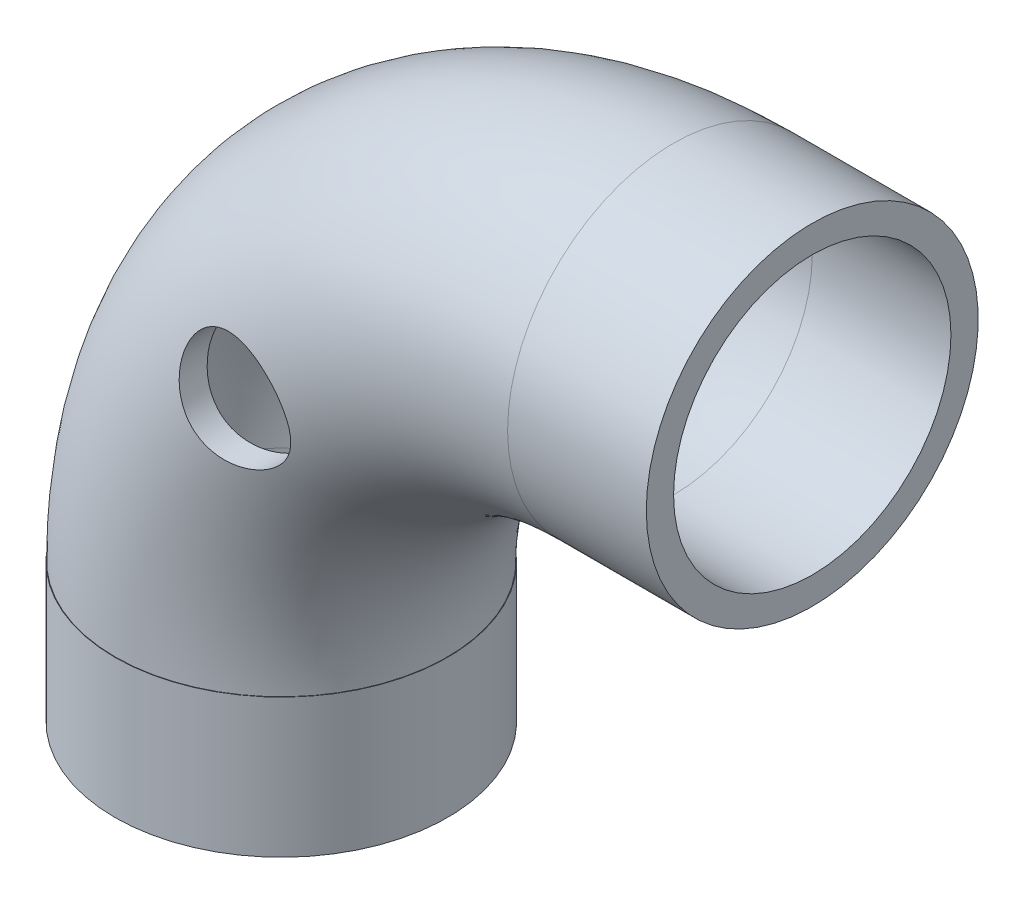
ISO-10303-21;
HEADER;
FILE_DESCRIPTION(('STEP AP214'),'2;1');
FILE_NAME('part.step','',(''),(''),'','','');
FILE_SCHEMA(('AUTOMOTIVE_DESIGN { 1 0 10303 214 1 1 1 1 }'));
ENDSEC;
DATA;
#1=APPLICATION_CONTEXT('core data for automotive mechanical design processes');
#2=APPLICATION_PROTOCOL_DEFINITION('international standard','automotive_design',2000,#1);
#3=PRODUCT_CONTEXT('',#1,'mechanical');
#4=PRODUCT('Part','Part','',(#3));
#5=PRODUCT_RELATED_PRODUCT_CATEGORY('part','',(#4));
#6=PRODUCT_DEFINITION_FORMATION('','',#4);
#7=PRODUCT_DEFINITION_CONTEXT('part definition',#1,'design');
#8=PRODUCT_DEFINITION('design','',#6,#7);
#9=PRODUCT_DEFINITION_SHAPE('','',#8);
#10=(LENGTH_UNIT() NAMED_UNIT(*) SI_UNIT(.MILLI.,.METRE.));
#11=(NAMED_UNIT(*) PLANE_ANGLE_UNIT() SI_UNIT($,.RADIAN.));
#12=(NAMED_UNIT(*) SI_UNIT($,.STERADIAN.) SOLID_ANGLE_UNIT());
#13=UNCERTAINTY_MEASURE_WITH_UNIT(LENGTH_MEASURE(1.E-05),#10,'distance_accuracy_value','');
#14=(GEOMETRIC_REPRESENTATION_CONTEXT(3) GLOBAL_UNCERTAINTY_ASSIGNED_CONTEXT((#13)) GLOBAL_UNIT_ASSIGNED_CONTEXT((#10,
#11,#12)) REPRESENTATION_CONTEXT('',''));
#15=CARTESIAN_POINT('',(0.,0.,0.));
#16=DIRECTION('',(0.,0.,1.));
#17=DIRECTION('',(1.,0.,0.));
#18=AXIS2_PLACEMENT_3D('',#15,#16,#17);
#19=CARTESIAN_POINT('',(0.,-25.4,0.));
#20=DIRECTION('',(-1.,0.,0.));
#21=DIRECTION('',(0.,0.,1.));
#22=AXIS2_PLACEMENT_3D('',#19,#20,#21);
#23=CYLINDRICAL_SURFACE('',#22,30.3950627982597);
#24=CARTESIAN_POINT('',(-0.000254,-25.4,0.));
#25=DIRECTION('',(-1.,0.,0.));
#26=DIRECTION('',(0.,0.,1.));
#27=AXIS2_PLACEMENT_3D('',#24,#25,#26);
#28=CIRCLE('',#27,30.3950627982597);
#29=CARTESIAN_POINT('',(-0.000254,-25.4,30.3950627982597));
#30=VERTEX_POINT('',#29);
#31=EDGE_CURVE('E12',#30,#30,#28,.T.);
#32=ORIENTED_EDGE('',*,*,#31,.F.);
#33=EDGE_LOOP('',(#32));
#34=FACE_BOUND('',#33,.T.);
#35=CARTESIAN_POINT('',(25.400254,-25.4,0.));
#36=DIRECTION('',(-1.,0.,0.));
#37=DIRECTION('',(0.,0.,1.));
#38=AXIS2_PLACEMENT_3D('',#35,#36,#37);
#39=CIRCLE('',#38,30.3950627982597);
#40=CARTESIAN_POINT('',(25.400254,-25.4,30.3950627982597));
#41=VERTEX_POINT('',#40);
#42=EDGE_CURVE('E74',#41,#41,#39,.T.);
#43=ORIENTED_EDGE('',*,*,#42,.T.);
#44=EDGE_LOOP('',(#43));
#45=FACE_BOUND('',#44,.T.);
#46=ADVANCED_FACE('F57',(#34,#45),#23,.T.);
#47=CARTESIAN_POINT('',(0.,-25.4,0.));
#48=DIRECTION('',(-1.,0.,0.));
#49=DIRECTION('',(0.,0.,1.));
#50=AXIS2_PLACEMENT_3D('',#47,#48,#49);
#51=CYLINDRICAL_SURFACE('',#50,25.399746);
#52=CARTESIAN_POINT('',(25.400254,-25.4,0.));
#53=DIRECTION('',(-1.,0.,0.));
#54=DIRECTION('',(0.,0.,1.));
#55=AXIS2_PLACEMENT_3D('',#52,#53,#54);
#56=CIRCLE('',#55,25.399746);
#57=CARTESIAN_POINT('',(25.400254,-25.4,25.399746));
#58=VERTEX_POINT('',#57);
#59=EDGE_CURVE('E69',#58,#58,#56,.T.);
#60=ORIENTED_EDGE('',*,*,#59,.F.);
#61=EDGE_LOOP('',(#60));
#62=FACE_BOUND('',#61,.T.);
#63=CARTESIAN_POINT('',(-0.000254,-25.4,0.));
#64=DIRECTION('',(-1.,0.,0.));
#65=DIRECTION('',(0.,0.,1.));
#66=AXIS2_PLACEMENT_3D('',#63,#64,#65);
#67=CIRCLE('',#66,25.399746);
#68=CARTESIAN_POINT('',(-0.000254,-25.4,25.399746));
#69=VERTEX_POINT('',#68);
#70=EDGE_CURVE('E148',#69,#69,#67,.F.);
#71=ORIENTED_EDGE('',*,*,#70,.F.);
#72=EDGE_LOOP('',(#71));
#73=FACE_BOUND('',#72,.T.);
#74=ADVANCED_FACE('F177',(#62,#73),#51,.F.);
#75=CARTESIAN_POINT('',(25.400254,0.,0.));
#76=DIRECTION('',(-1.,0.,0.));
#77=DIRECTION('',(0.,0.,1.));
#78=AXIS2_PLACEMENT_3D('',#75,#76,#77);
#79=PLANE('',#78);
#80=ORIENTED_EDGE('',*,*,#42,.F.);
#81=EDGE_LOOP('',(#80));
#82=FACE_BOUND('',#81,.T.);
#83=ORIENTED_EDGE('',*,*,#59,.T.);
#84=EDGE_LOOP('',(#83));
#85=FACE_BOUND('',#84,.T.);
#86=ADVANCED_FACE('F102',(#82,#85),#79,.F.);
#87=CARTESIAN_POINT('',(-0.000254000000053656,-97.2420489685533,0.));
#88=DIRECTION('',(0.,0.,1.));
#89=DIRECTION('',(1.,0.,0.));
#90=AXIS2_PLACEMENT_3D('',#87,#88,#89);
#91=TOROIDAL_SURFACE('',#90,71.8420489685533,30.3950627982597);
#92=CARTESIAN_POINT('',(-58.0154068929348,-53.5951719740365,-30.3856027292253));
#93=CARTESIAN_POINT('',(-58.2127297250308,-53.3961377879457,-30.378681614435));
#94=CARTESIAN_POINT('',(-58.4017464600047,-53.1889967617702,-30.3679963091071));
#95=CARTESIAN_POINT('',(-58.7618027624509,-52.7600982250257,-30.3395096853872));
#96=CARTESIAN_POINT('',(-58.9328419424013,-52.5383403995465,-30.3217082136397));
#97=CARTESIAN_POINT('',(-59.2558116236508,-52.0818483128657,-30.2795669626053));
#98=CARTESIAN_POINT('',(-59.4077382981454,-51.8471114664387,-30.2552258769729));
#99=CARTESIAN_POINT('',(-59.6914809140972,-51.3664349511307,-30.2007295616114));
#100=CARTESIAN_POINT('',(-59.8232968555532,-51.120495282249,-30.1705743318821));
#101=CARTESIAN_POINT('',(-60.0657997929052,-50.6196698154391,-30.1053502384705));
#102=CARTESIAN_POINT('',(-60.1765290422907,-50.3648031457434,-30.0702914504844));
#103=CARTESIAN_POINT('',(-60.3766279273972,-49.8472888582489,-29.9961138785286));
#104=CARTESIAN_POINT('',(-60.4659896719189,-49.5846384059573,-29.9569936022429));
#105=CARTESIAN_POINT('',(-60.6228406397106,-49.0533880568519,-29.8756831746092));
#106=CARTESIAN_POINT('',(-60.6903323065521,-48.7847888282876,-29.8334933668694));
#107=CARTESIAN_POINT('',(-60.8031347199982,-48.2432904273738,-29.7470536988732));
#108=CARTESIAN_POINT('',(-60.8484443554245,-47.9703910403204,-29.7028037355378));
#109=CARTESIAN_POINT('',(-60.9177117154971,-47.4135288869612,-29.611906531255));
#110=CARTESIAN_POINT('',(-60.9409695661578,-47.1294840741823,-29.565227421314));
#111=CARTESIAN_POINT('',(-60.9635542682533,-46.5604308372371,-29.4719357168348));
#112=CARTESIAN_POINT('',(-60.9628806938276,-46.2754223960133,-29.425323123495));
#113=CARTESIAN_POINT('',(-60.9375779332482,-45.706231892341,-29.3333032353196));
#114=CARTESIAN_POINT('',(-60.9129454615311,-45.4220499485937,-29.2878961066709));
#115=CARTESIAN_POINT('',(-60.8398098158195,-44.8564137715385,-29.1994195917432));
#116=CARTESIAN_POINT('',(-60.7913074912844,-44.5749594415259,-29.1563501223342));
#117=CARTESIAN_POINT('',(-60.6697947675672,-44.0127200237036,-29.0730483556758));
#118=CARTESIAN_POINT('',(-60.5964492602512,-43.7320000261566,-29.0328644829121));
#119=CARTESIAN_POINT('',(-60.4258369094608,-43.1774068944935,-28.9570923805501));
#120=CARTESIAN_POINT('',(-60.328579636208,-42.9035310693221,-28.9215023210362));
#121=CARTESIAN_POINT('',(-60.1106818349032,-42.3645464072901,-28.8558661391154));
#122=CARTESIAN_POINT('',(-59.9900411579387,-42.0994376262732,-28.8258200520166));
#123=CARTESIAN_POINT('',(-59.7261395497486,-41.5800526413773,-28.772113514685));
#124=CARTESIAN_POINT('',(-59.582879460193,-41.325776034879,-28.7484528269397));
#125=CARTESIAN_POINT('',(-59.2798180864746,-40.8382797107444,-28.7088595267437));
#126=CARTESIAN_POINT('',(-59.1207188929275,-40.6046419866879,-28.6926976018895));
#127=CARTESIAN_POINT('',(-58.7833995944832,-40.1511961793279,-28.6674207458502));
#128=CARTESIAN_POINT('',(-58.6051798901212,-39.9313878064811,-28.658305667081));
#129=CARTESIAN_POINT('',(-58.2309608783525,-39.5073431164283,-28.6473769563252));
#130=CARTESIAN_POINT('',(-58.0349648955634,-39.3031039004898,-28.6455619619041));
#131=CARTESIAN_POINT('',(-57.6266553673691,-38.9117226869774,-28.6492806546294));
#132=CARTESIAN_POINT('',(-57.4143421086,-38.7245803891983,-28.6548142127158));
#133=CARTESIAN_POINT('',(-56.9822010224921,-38.3745890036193,-28.6727767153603));
#134=CARTESIAN_POINT('',(-56.7628430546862,-38.2111472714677,-28.68497524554));
#135=CARTESIAN_POINT('',(-56.3119846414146,-37.9026677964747,-28.7157876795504));
#136=CARTESIAN_POINT('',(-56.0804845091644,-37.7576295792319,-28.7344014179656));
#137=CARTESIAN_POINT('',(-55.6070200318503,-37.4868850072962,-28.7775682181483));
#138=CARTESIAN_POINT('',(-55.3650570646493,-37.3611761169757,-28.8021204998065));
#139=CARTESIAN_POINT('',(-54.8722238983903,-37.1297558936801,-28.8565652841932));
#140=CARTESIAN_POINT('',(-54.6213503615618,-37.0240521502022,-28.8864598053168));
#141=CARTESIAN_POINT('',(-54.1090965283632,-36.8320037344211,-28.9512840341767));
#142=CARTESIAN_POINT('',(-53.8476211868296,-36.7459334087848,-28.9862750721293));
#143=CARTESIAN_POINT('',(-53.3189535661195,-36.5953576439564,-29.0601570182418));
#144=CARTESIAN_POINT('',(-53.0517588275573,-36.5308616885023,-29.0990496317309));
#145=CARTESIAN_POINT('',(-52.5134703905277,-36.4237760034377,-29.1798006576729));
#146=CARTESIAN_POINT('',(-52.2423768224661,-36.3811855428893,-29.2216589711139));
#147=CARTESIAN_POINT('',(-51.6979437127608,-36.3180745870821,-29.3073736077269));
#148=CARTESIAN_POINT('',(-51.4246041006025,-36.2975547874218,-29.3512299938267));
#149=CARTESIAN_POINT('',(-50.8661493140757,-36.2782668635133,-29.4417499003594));
#150=CARTESIAN_POINT('',(-50.5810086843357,-36.2804203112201,-29.4884549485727));
#151=CARTESIAN_POINT('',(-50.0119091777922,-36.3086742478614,-29.5817953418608));
#152=CARTESIAN_POINT('',(-49.7279502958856,-36.3347746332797,-29.628430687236));
#153=CARTESIAN_POINT('',(-49.1629857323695,-36.4107876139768,-29.7204893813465));
#154=CARTESIAN_POINT('',(-48.8819805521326,-36.4607041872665,-29.7659125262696));
#155=CARTESIAN_POINT('',(-48.3248179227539,-36.5840964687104,-29.8543986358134));
#156=CARTESIAN_POINT('',(-48.0486603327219,-36.6575714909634,-29.8974616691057));
#157=CARTESIAN_POINT('',(-47.4993533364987,-36.8288532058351,-29.9806793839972));
#158=CARTESIAN_POINT('',(-47.226294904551,-36.9269750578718,-30.020786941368));
#159=CARTESIAN_POINT('',(-46.6891268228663,-37.146438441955,-30.0963238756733));
#160=CARTESIAN_POINT('',(-46.4250136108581,-37.2677705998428,-30.1317551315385));
#161=CARTESIAN_POINT('',(-45.907599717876,-37.5329502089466,-30.1969371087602));
#162=CARTESIAN_POINT('',(-45.65429907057,-37.6767977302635,-30.2266878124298));
#163=CARTESIAN_POINT('',(-45.1605014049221,-37.9860658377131,-30.2795945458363));
#164=CARTESIAN_POINT('',(-44.9200038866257,-38.1514855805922,-30.3027508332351));
#165=CARTESIAN_POINT('',(-44.4617512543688,-38.4967083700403,-30.3410332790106));
#166=CARTESIAN_POINT('',(-44.2434993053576,-38.6758246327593,-30.3564073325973));
#167=CARTESIAN_POINT('',(-43.8224461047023,-39.0518220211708,-30.3797542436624));
#168=CARTESIAN_POINT('',(-43.6196445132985,-39.2487027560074,-30.3877272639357));
#169=CARTESIAN_POINT('',(-43.2311224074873,-39.6587168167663,-30.3959200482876));
#170=CARTESIAN_POINT('',(-43.0453979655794,-39.8718463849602,-30.3961415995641));
#171=CARTESIAN_POINT('',(-42.6924147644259,-40.3127516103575,-30.3886918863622));
#172=CARTESIAN_POINT('',(-42.5251556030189,-40.5405269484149,-30.3810207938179));
#173=CARTESIAN_POINT('',(-42.2161348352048,-41.0003223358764,-30.3582919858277));
#174=CARTESIAN_POINT('',(-42.0736623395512,-41.2318791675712,-30.3435159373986));
#175=CARTESIAN_POINT('',(-41.8079341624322,-41.7052305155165,-30.3069875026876));
#176=CARTESIAN_POINT('',(-41.6846779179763,-41.9470247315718,-30.285235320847));
#177=CARTESIAN_POINT('',(-41.4581100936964,-42.4391338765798,-30.2352176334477));
#178=CARTESIAN_POINT('',(-41.3547990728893,-42.6894490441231,-30.2069519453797));
#179=CARTESIAN_POINT('',(-41.1686675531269,-43.1968712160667,-30.1445529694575));
#180=CARTESIAN_POINT('',(-41.0858475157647,-43.4539783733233,-30.1104195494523));
#181=CARTESIAN_POINT('',(-40.940094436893,-43.9767923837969,-30.0366011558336));
#182=CARTESIAN_POINT('',(-40.8774447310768,-44.2425684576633,-29.9968475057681));
#183=CARTESIAN_POINT('',(-40.773787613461,-44.7777488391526,-29.9131273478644));
#184=CARTESIAN_POINT('',(-40.7327882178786,-45.0471544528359,-29.8691592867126));
#185=CARTESIAN_POINT('',(-40.6725729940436,-45.5878445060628,-29.7781554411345));
#186=CARTESIAN_POINT('',(-40.6533552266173,-45.8591287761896,-29.7311199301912));
#187=CARTESIAN_POINT('',(-40.63669956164,-46.4021607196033,-29.6351940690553));
#188=CARTESIAN_POINT('',(-40.6392718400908,-46.6739085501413,-29.5863028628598));
#189=CARTESIAN_POINT('',(-40.6668509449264,-47.2302506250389,-29.4854722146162));
#190=CARTESIAN_POINT('',(-40.6930095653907,-47.5147834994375,-29.4335057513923));
#191=CARTESIAN_POINT('',(-40.7692072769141,-48.0807032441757,-29.3306545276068));
#192=CARTESIAN_POINT('',(-40.8192362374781,-48.3620913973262,-29.2797693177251));
#193=CARTESIAN_POINT('',(-40.9429841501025,-48.9202726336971,-29.1806938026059));
#194=CARTESIAN_POINT('',(-41.0167163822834,-49.1970630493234,-29.1325050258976));
#195=CARTESIAN_POINT('',(-41.1875085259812,-49.7439814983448,-29.0405421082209));
#196=CARTESIAN_POINT('',(-41.2845584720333,-50.0141123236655,-28.9967660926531));
#197=CARTESIAN_POINT('',(-41.5023924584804,-50.5480371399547,-28.9148984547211));
#198=CARTESIAN_POINT('',(-41.623354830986,-50.8117656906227,-28.8768535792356));
#199=CARTESIAN_POINT('',(-41.8878692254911,-51.3286925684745,-28.8083698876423));
#200=CARTESIAN_POINT('',(-42.031421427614,-51.5818908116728,-28.777931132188));
#201=CARTESIAN_POINT('',(-42.3401062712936,-52.075537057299,-28.7259559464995));
#202=CARTESIAN_POINT('',(-42.5052258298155,-52.3159926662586,-28.7044141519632));
#203=CARTESIAN_POINT('',(-42.8558996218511,-52.7822304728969,-28.6711572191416));
#204=CARTESIAN_POINT('',(-43.0414523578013,-53.0080137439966,-28.6594413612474));
#205=CARTESIAN_POINT('',(-43.4183414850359,-53.4282633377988,-28.6468032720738));
#206=CARTESIAN_POINT('',(-43.6084474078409,-53.6238146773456,-28.6452074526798));
#207=CARTESIAN_POINT('',(-44.0036848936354,-53.9989312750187,-28.6510818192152));
#208=CARTESIAN_POINT('',(-44.2088157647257,-54.1784972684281,-28.6585515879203));
#209=CARTESIAN_POINT('',(-44.6325277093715,-54.5203444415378,-28.6822602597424));
#210=CARTESIAN_POINT('',(-44.8511090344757,-54.6826252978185,-28.6984993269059));
#211=CARTESIAN_POINT('',(-45.3000566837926,-54.9888179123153,-28.7391151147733));
#212=CARTESIAN_POINT('',(-45.5304231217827,-55.1327294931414,-28.7634919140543));
#213=CARTESIAN_POINT('',(-45.9958318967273,-55.3982340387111,-28.818824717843));
#214=CARTESIAN_POINT('',(-46.2306448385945,-55.5202641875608,-28.8496165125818));
#215=CARTESIAN_POINT('',(-46.7084518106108,-55.7454102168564,-28.917057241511));
#216=CARTESIAN_POINT('',(-46.9514487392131,-55.8485193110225,-28.9537082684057));
#217=CARTESIAN_POINT('',(-47.4440691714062,-56.0353290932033,-29.0316779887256));
#218=CARTESIAN_POINT('',(-47.6936930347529,-56.1190287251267,-29.0729969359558));
#219=CARTESIAN_POINT('',(-48.1981399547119,-56.2666955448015,-29.1590413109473));
#220=CARTESIAN_POINT('',(-48.4529633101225,-56.3306615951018,-29.2037669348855));
#221=CARTESIAN_POINT('',(-48.9832306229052,-56.4421563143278,-29.2983276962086));
#222=CARTESIAN_POINT('',(-49.2589333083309,-56.4883365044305,-29.3483057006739));
#223=CARTESIAN_POINT('',(-49.8129392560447,-56.5578149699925,-29.4490848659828));
#224=CARTESIAN_POINT('',(-50.091241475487,-56.5811220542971,-29.4998857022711));
#225=CARTESIAN_POINT('',(-50.6491235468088,-56.6047628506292,-29.6008547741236));
#226=CARTESIAN_POINT('',(-50.9287041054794,-56.6050817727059,-29.651022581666));
#227=CARTESIAN_POINT('',(-51.4872061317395,-56.58264931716,-29.7492373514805));
#228=CARTESIAN_POINT('',(-51.7661278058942,-56.5599065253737,-29.7972850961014));
#229=CARTESIAN_POINT('',(-52.3322831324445,-56.4900782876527,-29.8917093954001));
#230=CARTESIAN_POINT('',(-52.6194296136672,-56.4421001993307,-29.9379529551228));
#231=CARTESIAN_POINT('',(-53.1892936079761,-56.32146766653,-30.0253922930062));
#232=CARTESIAN_POINT('',(-53.4720109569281,-56.2488123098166,-30.0665878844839));
#233=CARTESIAN_POINT('',(-54.0308082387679,-56.0791824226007,-30.1427449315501));
#234=CARTESIAN_POINT('',(-54.3068906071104,-55.9822169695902,-30.1777087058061));
#235=CARTESIAN_POINT('',(-54.850347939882,-55.7644954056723,-30.2404563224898));
#236=CARTESIAN_POINT('',(-55.1177235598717,-55.6437410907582,-30.2682407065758));
#237=CARTESIAN_POINT('',(-55.6225494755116,-55.388842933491,-30.3141760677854));
#238=CARTESIAN_POINT('',(-55.8607630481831,-55.2563077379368,-30.3328800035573));
#239=CARTESIAN_POINT('',(-56.3260862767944,-54.9722929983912,-30.3631124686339));
#240=CARTESIAN_POINT('',(-56.5531965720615,-54.8208145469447,-30.3746414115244));
#241=CARTESIAN_POINT('',(-56.9946292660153,-54.4999496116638,-30.3903404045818));
#242=CARTESIAN_POINT('',(-57.2089529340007,-54.3305649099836,-30.3945111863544));
#243=CARTESIAN_POINT('',(-57.6232784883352,-53.9750730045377,-30.3955119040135));
#244=CARTESIAN_POINT('',(-57.8232799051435,-53.7889652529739,-30.3923415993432));
#245=CARTESIAN_POINT('',(-58.0154068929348,-53.5951719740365,-30.3856027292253));
#246=B_SPLINE_CURVE_WITH_KNOTS('',3,(#92,#93,#94,#95,#96,#97,#98,#99,#100,#101,#102,#103,#104,
#105,#106,#107,#108,#109,#110,#111,#112,#113,#114,#115,#116,#117,#118,#119,#120,#121,#122,#123,
#124,#125,#126,#127,#128,#129,#130,#131,#132,#133,#134,#135,#136,#137,#138,#139,#140,#141,#142,
#143,#144,#145,#146,#147,#148,#149,#150,#151,#152,#153,#154,#155,#156,#157,#158,#159,#160,#161,
#162,#163,#164,#165,#166,#167,#168,#169,#170,#171,#172,#173,#174,#175,#176,#177,#178,#179,#180,
#181,#182,#183,#184,#185,#186,#187,#188,#189,#190,#191,#192,#193,#194,#195,#196,#197,#198,#199,
#200,#201,#202,#203,#204,#205,#206,#207,#208,#209,#210,#211,#212,#213,#214,#215,#216,#217,#218,
#219,#220,#221,#222,#223,#224,#225,#226,#227,#228,#229,#230,#231,#232,#233,#234,#235,#236,#237,
#238,#239,#240,#241,#242,#243,#244,#245),.UNSPECIFIED.,.T.,.F.,(4,2,2,2,2,2,2,2,2,2,2,2,2,2,2,2,
2,2,2,2,2,2,2,2,2,2,2,2,2,2,2,2,2,2,2,2,2,2,2,2,2,2,2,2,2,2,2,2,2,2,2,2,2,2,2,2,2,2,2,2,2,2,2,2,
2,2,2,2,2,2,2,2,2,2,2,2,4),(0.,0.840807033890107,1.68163218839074,2.52262543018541,
3.36361867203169,4.20290857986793,5.0425079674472,5.88201351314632,6.72156110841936,
7.58694077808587,8.45233584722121,9.31784960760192,10.1833325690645,11.0609884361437,
11.9382936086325,12.8156043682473,13.6928824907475,14.5412029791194,15.3895057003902,
16.2376500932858,17.0857795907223,17.9062899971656,18.7267792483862,19.5471607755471,
20.3678529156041,21.199392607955,22.0312973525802,22.8631743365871,23.6950775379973,
24.5609204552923,25.4267596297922,26.2927434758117,27.1587021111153,28.0363540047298,
28.9136521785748,29.7909530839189,30.668219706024,31.5154362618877,32.3626341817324,
33.2096367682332,34.0566209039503,34.8724945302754,35.6883442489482,36.5042168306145,
37.3201077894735,38.1470046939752,38.9742075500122,39.8013367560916,40.6288522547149,
41.4991056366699,42.3689900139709,43.2393626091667,44.1093638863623,44.9861163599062,
45.8628758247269,46.7391058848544,47.6152717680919,48.4324487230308,49.2495880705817,
50.066742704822,50.8839052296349,51.6822737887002,52.4809281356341,53.2796259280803,
54.0783697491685,54.9293475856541,55.7799975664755,56.6311948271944,57.482075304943,
58.365306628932,59.2485706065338,60.1315052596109,61.014373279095,61.8331422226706,
62.6518639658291,63.4705043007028,64.2891714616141),.UNSPECIFIED.);
#247=CARTESIAN_POINT('',(-58.0154068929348,-53.5951719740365,-30.3856027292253));
#248=VERTEX_POINT('',#247);
#249=EDGE_CURVE('E119',#248,#248,#246,.T.);
#250=ORIENTED_EDGE('',*,*,#249,.F.);
#251=EDGE_LOOP('',(#250));
#252=FACE_BOUND('',#251,.T.);
#253=CARTESIAN_POINT('',(-58.0154068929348,-53.5951719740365,30.3856027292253));
#254=CARTESIAN_POINT('',(-57.8222381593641,-53.7900165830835,30.392378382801));
#255=CARTESIAN_POINT('',(-57.6211129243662,-53.9770878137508,30.3955461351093));
#256=CARTESIAN_POINT('',(-57.2043932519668,-54.3343178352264,30.3944600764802));
#257=CARTESIAN_POINT('',(-56.9887995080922,-54.5044774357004,30.3902066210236));
#258=CARTESIAN_POINT('',(-56.544759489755,-54.8266474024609,30.3742654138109));
#259=CARTESIAN_POINT('',(-56.3163149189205,-54.9786601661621,30.3625786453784));
#260=CARTESIAN_POINT('',(-55.8482405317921,-55.2635281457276,30.3319604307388));
#261=CARTESIAN_POINT('',(-55.6086105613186,-55.3963830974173,30.3130288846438));
#262=CARTESIAN_POINT('',(-55.1202171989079,-55.6419479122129,30.2683387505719));
#263=CARTESIAN_POINT('',(-54.8714649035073,-55.7546813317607,30.2425882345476));
#264=CARTESIAN_POINT('',(-54.3663335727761,-55.9595571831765,30.1848331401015));
#265=CARTESIAN_POINT('',(-54.1099545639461,-56.0516996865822,30.1528285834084));
#266=CARTESIAN_POINT('',(-53.5913216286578,-56.2149426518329,30.0833265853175));
#267=CARTESIAN_POINT('',(-53.3290677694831,-56.2860433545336,30.0458292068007));
#268=CARTESIAN_POINT('',(-52.8002798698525,-56.4069417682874,29.9662455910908));
#269=CARTESIAN_POINT('',(-52.533744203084,-56.4567311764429,29.9241575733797));
#270=CARTESIAN_POINT('',(-51.9914559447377,-56.5357884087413,29.8353700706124));
#271=CARTESIAN_POINT('',(-51.7156389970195,-56.5645149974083,29.7885819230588));
#272=CARTESIAN_POINT('',(-51.1628849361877,-56.5993530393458,29.6925514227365));
#273=CARTESIAN_POINT('',(-50.8859473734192,-56.6054542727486,29.6433079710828));
#274=CARTESIAN_POINT('',(-50.3326533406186,-56.595054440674,29.5437496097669));
#275=CARTESIAN_POINT('',(-50.0562969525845,-56.5785503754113,29.4934345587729));
#276=CARTESIAN_POINT('',(-49.5057811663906,-56.5230450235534,29.3931900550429));
#277=CARTESIAN_POINT('',(-49.2316217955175,-56.4840434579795,29.3432606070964));
#278=CARTESIAN_POINT('',(-48.6745247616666,-56.3814021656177,29.2430334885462));
#279=CARTESIAN_POINT('',(-48.3917640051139,-56.3167108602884,29.192824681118));
#280=CARTESIAN_POINT('',(-47.8323118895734,-56.1632125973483,29.096236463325));
#281=CARTESIAN_POINT('',(-47.5556181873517,-56.0744151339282,29.0498555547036));
#282=CARTESIAN_POINT('',(-47.0100984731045,-55.8731061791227,28.9626109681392));
#283=CARTESIAN_POINT('',(-46.7412720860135,-55.7605958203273,28.9217470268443));
#284=CARTESIAN_POINT('',(-46.213481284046,-55.5124478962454,28.8471383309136));
#285=CARTESIAN_POINT('',(-45.9545163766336,-55.3768114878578,28.8133932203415));
#286=CARTESIAN_POINT('',(-45.455725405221,-55.0874156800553,28.7552639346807));
#287=CARTESIAN_POINT('',(-45.2155644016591,-54.9342819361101,28.730640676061));
#288=CARTESIAN_POINT('',(-44.7484476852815,-54.6079780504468,28.6904549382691));
#289=CARTESIAN_POINT('',(-44.5214917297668,-54.4348082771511,28.6748922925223));
#290=CARTESIAN_POINT('',(-44.0827889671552,-54.0698042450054,28.6535004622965));
#291=CARTESIAN_POINT('',(-43.8710356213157,-53.8779780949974,28.6476670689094));
#292=CARTESIAN_POINT('',(-43.4644249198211,-53.4771537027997,28.6459772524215));
#293=CARTESIAN_POINT('',(-43.2695667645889,-53.268156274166,28.6501203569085));
#294=CARTESIAN_POINT('',(-42.9106869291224,-52.8491769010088,28.6675956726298));
#295=CARTESIAN_POINT('',(-42.745476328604,-52.6401847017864,28.6802984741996));
#296=CARTESIAN_POINT('',(-42.4322539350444,-52.2103150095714,28.7137544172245));
#297=CARTESIAN_POINT('',(-42.2842413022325,-51.9894380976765,28.7345071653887));
#298=CARTESIAN_POINT('',(-42.0062956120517,-51.5373710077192,28.7833074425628));
#299=CARTESIAN_POINT('',(-41.8763624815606,-51.3061808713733,28.8113549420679));
#300=CARTESIAN_POINT('',(-41.6352096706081,-50.8349576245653,28.8737784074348));
#301=CARTESIAN_POINT('',(-41.5239973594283,-50.5949210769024,28.9081568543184));
#302=CARTESIAN_POINT('',(-41.3189417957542,-50.1030130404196,28.9827935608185));
#303=CARTESIAN_POINT('',(-41.225465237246,-49.8510037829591,29.023150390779));
#304=CARTESIAN_POINT('',(-41.0588831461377,-49.3408970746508,29.1079515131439));
#305=CARTESIAN_POINT('',(-40.9857865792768,-49.082796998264,29.1523975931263));
#306=CARTESIAN_POINT('',(-40.8602920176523,-48.5620696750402,29.2440013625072));
#307=CARTESIAN_POINT('',(-40.8078955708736,-48.2994420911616,29.2911592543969));
#308=CARTESIAN_POINT('',(-40.7240068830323,-47.7711070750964,29.3868122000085));
#309=CARTESIAN_POINT('',(-40.6925154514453,-47.5053995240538,29.4353073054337));
#310=CARTESIAN_POINT('',(-40.6491116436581,-46.9536566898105,29.535683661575));
#311=CARTESIAN_POINT('',(-40.6387237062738,-46.6675001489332,29.5875643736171));
#312=CARTESIAN_POINT('',(-40.6421472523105,-46.0951460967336,29.6897132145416));
#313=CARTESIAN_POINT('',(-40.655950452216,-45.8089486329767,29.7399818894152));
#314=CARTESIAN_POINT('',(-40.7077633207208,-45.2381519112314,29.8374568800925));
#315=CARTESIAN_POINT('',(-40.7457784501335,-44.9535530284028,29.8846625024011));
#316=CARTESIAN_POINT('',(-40.8459268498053,-44.3879167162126,29.9746442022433));
#317=CARTESIAN_POINT('',(-40.9080596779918,-44.1068792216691,30.01742036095));
#318=CARTESIAN_POINT('',(-41.0564395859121,-43.5494503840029,30.0974750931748));
#319=CARTESIAN_POINT('',(-41.1427630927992,-43.273076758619,30.1347356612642));
#320=CARTESIAN_POINT('',(-41.3390073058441,-42.7279787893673,30.2025747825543));
#321=CARTESIAN_POINT('',(-41.4489282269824,-42.4592545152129,30.2331532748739));
#322=CARTESIAN_POINT('',(-41.6916674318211,-41.9316675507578,30.2868153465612));
#323=CARTESIAN_POINT('',(-41.8244787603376,-41.6728018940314,30.3099011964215));
#324=CARTESIAN_POINT('',(-42.112107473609,-41.1669808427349,30.3480256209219));
#325=CARTESIAN_POINT('',(-42.2669237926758,-40.9200248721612,30.3630645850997));
#326=CARTESIAN_POINT('',(-42.5889628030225,-40.452328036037,30.3842354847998));
#327=CARTESIAN_POINT('',(-42.7551507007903,-40.2308925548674,30.390782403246));
#328=CARTESIAN_POINT('',(-43.1050925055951,-39.8022729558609,30.3963075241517));
#329=CARTESIAN_POINT('',(-43.2888457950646,-39.5950883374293,30.3952859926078));
#330=CARTESIAN_POINT('',(-43.6725400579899,-39.1965114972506,30.3858310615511));
#331=CARTESIAN_POINT('',(-43.8724798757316,-39.0051181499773,30.3773981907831));
#332=CARTESIAN_POINT('',(-44.2870602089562,-38.6394659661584,30.3534667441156));
#333=CARTESIAN_POINT('',(-44.5017007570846,-38.465207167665,30.3379681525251));
#334=CARTESIAN_POINT('',(-44.9402052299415,-38.1378950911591,30.3007477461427));
#335=CARTESIAN_POINT('',(-45.163841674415,-37.9845237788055,30.2791397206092));
#336=CARTESIAN_POINT('',(-45.6222776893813,-37.6963361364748,30.2302097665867));
#337=CARTESIAN_POINT('',(-45.8570812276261,-37.5615264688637,30.2028857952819));
#338=CARTESIAN_POINT('',(-46.3361237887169,-37.3113235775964,30.1432634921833));
#339=CARTESIAN_POINT('',(-46.5803603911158,-37.195925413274,30.1109664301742));
#340=CARTESIAN_POINT('',(-47.0768280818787,-36.9850691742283,30.0421902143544));
#341=CARTESIAN_POINT('',(-47.3290622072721,-36.8896187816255,30.0057094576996));
#342=CARTESIAN_POINT('',(-47.8485369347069,-36.7162861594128,29.9281528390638));
#343=CARTESIAN_POINT('',(-48.1159962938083,-36.639110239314,29.8869630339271));
#344=CARTESIAN_POINT('',(-48.6560796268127,-36.5069877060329,29.80205066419));
#345=CARTESIAN_POINT('',(-48.9287058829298,-36.4520511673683,29.758326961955));
#346=CARTESIAN_POINT('',(-49.4773672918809,-36.3647104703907,29.6694000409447));
#347=CARTESIAN_POINT('',(-49.7534031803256,-36.3323112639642,29.6241964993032));
#348=CARTESIAN_POINT('',(-50.3070148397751,-36.290233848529,29.5334018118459));
#349=CARTESIAN_POINT('',(-50.584589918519,-36.2805461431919,29.4878108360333));
#350=CARTESIAN_POINT('',(-51.1502673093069,-36.2839932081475,29.3955642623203));
#351=CARTESIAN_POINT('',(-51.4383688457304,-36.2980092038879,29.348934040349));
#352=CARTESIAN_POINT('',(-52.0125291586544,-36.3505146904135,29.257574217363));
#353=CARTESIAN_POINT('',(-52.2985886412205,-36.3889952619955,29.212843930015));
#354=CARTESIAN_POINT('',(-52.8669566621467,-36.4902805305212,29.1263895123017));
#355=CARTESIAN_POINT('',(-53.1492636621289,-36.5530949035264,29.0846665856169));
#356=CARTESIAN_POINT('',(-53.7079210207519,-36.7027134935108,29.0053507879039));
#357=CARTESIAN_POINT('',(-53.9842737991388,-36.7895077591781,28.9677562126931));
#358=CARTESIAN_POINT('',(-54.5274115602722,-36.9860049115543,28.8979034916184));
#359=CARTESIAN_POINT('',(-54.7942459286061,-37.0955597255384,28.8656131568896));
#360=CARTESIAN_POINT('',(-55.3181691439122,-37.3372553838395,28.8069596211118));
#361=CARTESIAN_POINT('',(-55.5752579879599,-37.4693962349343,28.7805964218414));
#362=CARTESIAN_POINT('',(-56.0776221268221,-37.7553638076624,28.7345388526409));
#363=CARTESIAN_POINT('',(-56.3229005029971,-37.9091848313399,28.7148427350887));
#364=CARTESIAN_POINT('',(-56.7997466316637,-38.2374488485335,28.6826730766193));
#365=CARTESIAN_POINT('',(-57.0313148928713,-38.4118910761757,28.6701992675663));
#366=CARTESIAN_POINT('',(-57.469778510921,-38.7726070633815,28.6531872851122));
#367=CARTESIAN_POINT('',(-57.6772936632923,-38.9581138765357,28.6483477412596));
#368=CARTESIAN_POINT('',(-58.0764232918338,-39.3455493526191,28.6457787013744));
#369=CARTESIAN_POINT('',(-58.2680382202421,-39.5474775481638,28.6480490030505));
#370=CARTESIAN_POINT('',(-58.6339482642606,-39.966236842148,28.6596376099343));
#371=CARTESIAN_POINT('',(-58.808244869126,-40.1830666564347,28.6689553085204));
#372=CARTESIAN_POINT('',(-59.1383060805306,-40.6300213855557,28.694387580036));
#373=CARTESIAN_POINT('',(-59.2940706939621,-40.8601462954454,28.7105021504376));
#374=CARTESIAN_POINT('',(-59.5835379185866,-41.3279609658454,28.748771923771));
#375=CARTESIAN_POINT('',(-59.7175709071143,-41.5654553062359,28.7708196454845));
#376=CARTESIAN_POINT('',(-59.965960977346,-42.050058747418,28.820525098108));
#377=CARTESIAN_POINT('',(-60.08031097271,-42.2971712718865,28.8481848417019));
#378=CARTESIAN_POINT('',(-60.2886144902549,-42.7991859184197,28.9084242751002));
#379=CARTESIAN_POINT('',(-60.3825732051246,-43.0540860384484,28.9410027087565));
#380=CARTESIAN_POINT('',(-60.5496891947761,-43.5701659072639,29.0103208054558));
#381=CARTESIAN_POINT('',(-60.6228384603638,-43.8313480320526,29.0470620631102));
#382=CARTESIAN_POINT('',(-60.7498028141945,-44.3660442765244,29.1249767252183));
#383=CARTESIAN_POINT('',(-60.802983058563,-44.6396947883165,29.1662489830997));
#384=CARTESIAN_POINT('',(-60.8866785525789,-45.1901753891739,29.251313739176));
#385=CARTESIAN_POINT('',(-60.9171835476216,-45.467006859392,29.2951073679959));
#386=CARTESIAN_POINT('',(-60.9553812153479,-46.0220589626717,29.3841705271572));
#387=CARTESIAN_POINT('',(-60.963069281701,-46.3002798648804,29.4294403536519));
#388=CARTESIAN_POINT('',(-60.9556126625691,-46.8562287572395,29.5203663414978));
#389=CARTESIAN_POINT('',(-60.9404775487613,-47.1339569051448,29.5660223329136));
#390=CARTESIAN_POINT('',(-60.8865079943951,-47.697474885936,29.6583298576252));
#391=CARTESIAN_POINT('',(-60.8468271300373,-47.9831881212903,29.7049567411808));
#392=CARTESIAN_POINT('',(-60.743269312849,-48.5503966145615,29.7962956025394));
#393=CARTESIAN_POINT('',(-60.6794012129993,-48.8318933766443,29.8410082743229));
#394=CARTESIAN_POINT('',(-60.5277647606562,-49.3889978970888,29.9273965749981));
#395=CARTESIAN_POINT('',(-60.4399856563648,-49.664602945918,29.9690708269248));
#396=CARTESIAN_POINT('',(-60.2410565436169,-50.2077433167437,30.0482244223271));
#397=CARTESIAN_POINT('',(-60.1299161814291,-50.4752819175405,30.0857054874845));
#398=CARTESIAN_POINT('',(-59.8845314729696,-51.0012095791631,30.1555419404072));
#399=CARTESIAN_POINT('',(-59.7502212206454,-51.2595699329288,30.1878821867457));
#400=CARTESIAN_POINT('',(-59.4595646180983,-51.7643373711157,30.2463404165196));
#401=CARTESIAN_POINT('',(-59.303218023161,-52.0107443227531,30.272458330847));
#402=CARTESIAN_POINT('',(-58.969615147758,-52.4895480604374,30.3176267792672));
#403=CARTESIAN_POINT('',(-58.7923657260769,-52.7219494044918,30.3366796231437));
#404=CARTESIAN_POINT('',(-58.418226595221,-53.1709020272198,30.3670557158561));
#405=CARTESIAN_POINT('',(-58.2213380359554,-53.3874542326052,30.3783794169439));
#406=CARTESIAN_POINT('',(-58.0154068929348,-53.5951719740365,30.3856027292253));
#407=B_SPLINE_CURVE_WITH_KNOTS('',3,(#253,#254,#255,#256,#257,#258,#259,#260,#261,#262,#263,
#264,#265,#266,#267,#268,#269,#270,#271,#272,#273,#274,#275,#276,#277,#278,#279,#280,#281,#282,
#283,#284,#285,#286,#287,#288,#289,#290,#291,#292,#293,#294,#295,#296,#297,#298,#299,#300,#301,
#302,#303,#304,#305,#306,#307,#308,#309,#310,#311,#312,#313,#314,#315,#316,#317,#318,#319,#320,
#321,#322,#323,#324,#325,#326,#327,#328,#329,#330,#331,#332,#333,#334,#335,#336,#337,#338,#339,
#340,#341,#342,#343,#344,#345,#346,#347,#348,#349,#350,#351,#352,#353,#354,#355,#356,#357,#358,
#359,#360,#361,#362,#363,#364,#365,#366,#367,#368,#369,#370,#371,#372,#373,#374,#375,#376,#377,
#378,#379,#380,#381,#382,#383,#384,#385,#386,#387,#388,#389,#390,#391,#392,#393,#394,#395,#396,
#397,#398,#399,#400,#401,#402,#403,#404,#405,#406),.UNSPECIFIED.,.T.,.F.,(4,2,2,2,2,2,2,2,2,2,2,
2,2,2,2,2,2,2,2,2,2,2,2,2,2,2,2,2,2,2,2,2,2,2,2,2,2,2,2,2,2,2,2,2,2,2,2,2,2,2,2,2,2,2,2,2,2,2,2,
2,2,2,2,2,2,2,2,2,2,2,2,2,2,2,2,2,4),(0.,0.823095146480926,1.6461508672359,2.46909773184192,
3.29205594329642,4.11404429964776,4.93602980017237,5.75800589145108,6.58030193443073,
7.4230509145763,8.26618051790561,9.10942201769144,9.95267397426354,10.83474558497,
11.7164702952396,12.5981529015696,13.4797914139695,14.3363380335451,15.192868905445,
16.0490291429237,16.9051488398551,17.7043355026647,18.5034831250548,19.3026275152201,
20.1020857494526,20.9166052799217,21.7314825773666,22.5464208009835,23.3613905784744,
24.2333945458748,25.1050999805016,25.9770020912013,26.8488882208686,27.7235606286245,
28.598241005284,29.4726560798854,30.3470288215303,31.1768274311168,32.0065968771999,
32.8363071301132,33.6660192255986,34.4811946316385,35.2966618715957,36.1119212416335,
36.9274940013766,37.7707505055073,38.6143885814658,39.4582119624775,40.3016824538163,
41.1772041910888,42.0524069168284,42.9279580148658,43.8031463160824,44.6728098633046,
45.5424736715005,46.4119093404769,47.2813127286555,48.1154503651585,48.9495642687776,
49.7836063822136,50.6176481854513,51.4374943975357,52.2576351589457,53.0775668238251,
53.8978136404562,54.7422864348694,55.5871408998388,56.4321659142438,57.2768366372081,
58.1523962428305,59.027635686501,59.9032693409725,60.7785421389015,61.6563469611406,
62.5341615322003,63.4116888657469,64.2891648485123),.UNSPECIFIED.);
#408=CARTESIAN_POINT('',(-58.0154068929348,-53.5951719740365,30.3856027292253));
#409=VERTEX_POINT('',#408);
#410=EDGE_CURVE('E114',#409,#409,#407,.T.);
#411=ORIENTED_EDGE('',*,*,#410,.F.);
#412=EDGE_LOOP('',(#411));
#413=FACE_BOUND('',#412,.T.);
#414=CARTESIAN_POINT('',(-71.8423029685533,-97.2420489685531,0.));
#415=DIRECTION('',(0.,-1.,0.));
#416=DIRECTION('',(0.,0.,1.));
#417=AXIS2_PLACEMENT_3D('',#414,#415,#416);
#418=CIRCLE('',#417,30.3950627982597);
#419=CARTESIAN_POINT('',(-71.8423029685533,-97.2420489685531,30.3950627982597));
#420=VERTEX_POINT('',#419);
#421=EDGE_CURVE('E156',#420,#420,#418,.T.);
#422=ORIENTED_EDGE('',*,*,#421,.F.);
#423=EDGE_LOOP('',(#422));
#424=FACE_BOUND('',#423,.T.);
#425=ORIENTED_EDGE('',*,*,#31,.T.);
#426=EDGE_LOOP('',(#425));
#427=FACE_BOUND('',#426,.T.);
#428=ADVANCED_FACE('F100',(#252,#413,#424,#427),#91,.T.);
#429=CARTESIAN_POINT('',(-0.000254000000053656,-97.2420489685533,0.));
#430=DIRECTION('',(0.,0.,1.));
#431=DIRECTION('',(1.,0.,0.));
#432=AXIS2_PLACEMENT_3D('',#429,#430,#431);
#433=TOROIDAL_SURFACE('',#432,71.8420489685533,25.399746);
#434=CARTESIAN_POINT('',(-58.0106116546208,-53.6000055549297,-25.3886250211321));
#435=CARTESIAN_POINT('',(-57.8208003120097,-53.7912039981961,-25.3965162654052));
#436=CARTESIAN_POINT('',(-57.6232292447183,-53.9749939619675,-25.4002466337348));
#437=CARTESIAN_POINT('',(-57.2140175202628,-54.3263393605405,-25.3991367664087));
#438=CARTESIAN_POINT('',(-57.0023685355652,-54.4938850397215,-25.3942914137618));
#439=CARTESIAN_POINT('',(-56.5661795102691,-54.81179679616,-25.3759851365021));
#440=CARTESIAN_POINT('',(-56.3416127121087,-54.9621251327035,-25.3625056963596));
#441=CARTESIAN_POINT('',(-55.8817504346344,-55.244136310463,-25.327127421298));
#442=CARTESIAN_POINT('',(-55.6464565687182,-55.3758219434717,-25.3052298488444));
#443=CARTESIAN_POINT('',(-55.1674587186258,-55.6194749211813,-25.2535196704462));
#444=CARTESIAN_POINT('',(-54.9237770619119,-55.7314904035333,-25.2237268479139));
#445=CARTESIAN_POINT('',(-54.4291890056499,-55.9356262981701,-25.1568503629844));
#446=CARTESIAN_POINT('',(-54.1782823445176,-56.0277459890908,-25.1197664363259));
#447=CARTESIAN_POINT('',(-53.6710986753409,-56.1916560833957,-25.0391751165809));
#448=CARTESIAN_POINT('',(-53.4148248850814,-56.2634583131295,-24.9956714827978));
#449=CARTESIAN_POINT('',(-52.8982804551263,-56.3866161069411,-24.9032175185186));
#450=CARTESIAN_POINT('',(-52.6380082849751,-56.4379636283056,-24.8542650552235));
#451=CARTESIAN_POINT('',(-52.1064191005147,-56.5214486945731,-24.750389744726));
#452=CARTESIAN_POINT('',(-51.8350216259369,-56.5528942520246,-24.6953229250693));
#453=CARTESIAN_POINT('',(-51.2911210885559,-56.5938500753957,-24.5820088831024));
#454=CARTESIAN_POINT('',(-51.0186175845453,-56.6033504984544,-24.5237602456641));
#455=CARTESIAN_POINT('',(-50.4739691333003,-56.6004608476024,-24.4056095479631));
#456=CARTESIAN_POINT('',(-50.2018243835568,-56.5880616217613,-24.345706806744));
#457=CARTESIAN_POINT('',(-49.6594058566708,-56.5414632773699,-24.2259012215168));
#458=CARTESIAN_POINT('',(-49.3891321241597,-56.5072636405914,-24.1659983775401));
#459=CARTESIAN_POINT('',(-48.8336755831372,-56.4141464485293,-24.0439103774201));
#460=CARTESIAN_POINT('',(-48.5487186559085,-56.3537155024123,-23.9818443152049));
#461=CARTESIAN_POINT('',(-47.9843462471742,-56.2083757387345,-23.8618323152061));
#462=CARTESIAN_POINT('',(-47.7049286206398,-56.1234766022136,-23.8038847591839));
#463=CARTESIAN_POINT('',(-47.1533758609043,-55.9294786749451,-23.6942511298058));
#464=CARTESIAN_POINT('',(-46.8812398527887,-55.8203828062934,-23.6425643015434));
#465=CARTESIAN_POINT('',(-46.3462223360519,-55.5784256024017,-23.5475441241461));
#466=CARTESIAN_POINT('',(-46.0833401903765,-55.4455659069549,-23.504210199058));
#467=CARTESIAN_POINT('',(-45.5776529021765,-55.1616396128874,-23.4290883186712));
#468=CARTESIAN_POINT('',(-45.3344697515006,-55.0113370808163,-23.3969606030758));
#469=CARTESIAN_POINT('',(-44.8608259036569,-54.6901188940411,-23.3437049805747));
#470=CARTESIAN_POINT('',(-44.6303648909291,-54.5192037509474,-23.3225768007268));
#471=CARTESIAN_POINT('',(-44.1844225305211,-54.1581759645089,-23.2923189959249));
#472=CARTESIAN_POINT('',(-43.9689306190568,-53.9680770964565,-23.283180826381));
#473=CARTESIAN_POINT('',(-43.5547533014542,-53.5702155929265,-23.2773186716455));
#474=CARTESIAN_POINT('',(-43.3560665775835,-53.3624543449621,-23.280593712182));
#475=CARTESIAN_POINT('',(-42.9959710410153,-52.9524792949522,-23.2984614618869));
#476=CARTESIAN_POINT('',(-42.8328184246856,-52.751741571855,-23.3119053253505));
#477=CARTESIAN_POINT('',(-42.5226694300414,-52.3389824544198,-23.3482133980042));
#478=CARTESIAN_POINT('',(-42.375671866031,-52.1269618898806,-23.3710769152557));
#479=CARTESIAN_POINT('',(-42.0986545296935,-51.6931455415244,-23.4253760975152));
#480=CARTESIAN_POINT('',(-41.968636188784,-51.4713489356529,-23.4568124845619));
#481=CARTESIAN_POINT('',(-41.7261561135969,-51.0194001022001,-23.5271617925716));
#482=CARTESIAN_POINT('',(-41.6137014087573,-50.7892445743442,-23.5660776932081));
#483=CARTESIAN_POINT('',(-41.4046953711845,-50.3172356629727,-23.6509641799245));
#484=CARTESIAN_POINT('',(-41.3085211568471,-50.0752387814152,-23.697064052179));
#485=CARTESIAN_POINT('',(-41.1352362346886,-49.5853852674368,-23.7942555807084));
#486=CARTESIAN_POINT('',(-41.0581337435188,-49.3375261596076,-23.8453493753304));
#487=CARTESIAN_POINT('',(-40.9232360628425,-48.8373010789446,-23.9510035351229));
#488=CARTESIAN_POINT('',(-40.8654436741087,-48.5849344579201,-24.0055644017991));
#489=CARTESIAN_POINT('',(-40.7693236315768,-48.0769404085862,-24.1166357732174));
#490=CARTESIAN_POINT('',(-40.7309971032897,-47.8213127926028,-24.1731463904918));
#491=CARTESIAN_POINT('',(-40.6709859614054,-47.2815005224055,-24.2924955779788));
#492=CARTESIAN_POINT('',(-40.6514246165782,-46.997088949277,-24.3553858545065));
#493=CARTESIAN_POINT('',(-40.6362711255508,-46.4274330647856,-24.4798220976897));
#494=CARTESIAN_POINT('',(-40.6406713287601,-46.1421890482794,-24.541368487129));
#495=CARTESIAN_POINT('',(-40.6735239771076,-45.5723289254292,-24.6613762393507));
#496=CARTESIAN_POINT('',(-40.7019842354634,-45.2877130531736,-24.7198365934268));
#497=CARTESIAN_POINT('',(-40.782996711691,-44.7209768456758,-24.8319995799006));
#498=CARTESIAN_POINT('',(-40.8355485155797,-44.4388564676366,-24.8857022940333));
#499=CARTESIAN_POINT('',(-40.9655641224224,-43.8750818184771,-24.9875734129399));
#500=CARTESIAN_POINT('',(-41.0433666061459,-43.5934894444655,-25.0356537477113));
#501=CARTESIAN_POINT('',(-41.223386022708,-43.0369453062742,-25.124048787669));
#502=CARTESIAN_POINT('',(-41.325603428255,-42.7619936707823,-25.1643633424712));
#503=CARTESIAN_POINT('',(-41.5538818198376,-42.2211102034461,-25.2361080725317));
#504=CARTESIAN_POINT('',(-41.6799317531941,-41.9551742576,-25.2675423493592));
#505=CARTESIAN_POINT('',(-41.9550965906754,-41.4345073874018,-25.3207316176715));
#506=CARTESIAN_POINT('',(-42.1042097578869,-41.1797756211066,-25.3424873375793));
#507=CARTESIAN_POINT('',(-42.4130832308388,-40.701295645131,-25.3746447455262));
#508=CARTESIAN_POINT('',(-42.5713515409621,-40.4766292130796,-25.3857388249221));
#509=CARTESIAN_POINT('',(-42.9057109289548,-40.0407026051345,-25.3989869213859));
#510=CARTESIAN_POINT('',(-43.0818011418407,-39.8294417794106,-25.4011413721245));
#511=CARTESIAN_POINT('',(-43.4504530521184,-39.4219701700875,-25.3966050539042));
#512=CARTESIAN_POINT('',(-43.6430128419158,-39.225757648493,-25.3899153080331));
#513=CARTESIAN_POINT('',(-44.0431324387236,-38.8497984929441,-25.3680169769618));
#514=CARTESIAN_POINT('',(-44.2506922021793,-38.6700518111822,-25.3528084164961));
#515=CARTESIAN_POINT('',(-44.6724397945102,-38.3336616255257,-25.3150102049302));
#516=CARTESIAN_POINT('',(-44.8862118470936,-38.1764681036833,-25.2926685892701));
#517=CARTESIAN_POINT('',(-45.3248885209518,-37.8795641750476,-25.2411232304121));
#518=CARTESIAN_POINT('',(-45.5497970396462,-37.7398599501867,-25.2119170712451));
#519=CARTESIAN_POINT('',(-46.0090897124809,-37.4787846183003,-25.1474181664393));
#520=CARTESIAN_POINT('',(-46.2434713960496,-37.3574087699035,-25.1121270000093));
#521=CARTESIAN_POINT('',(-46.7203438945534,-37.1334855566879,-25.0362978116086));
#522=CARTESIAN_POINT('',(-46.9628378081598,-37.0309454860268,-24.9957577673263));
#523=CARTESIAN_POINT('',(-47.4646587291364,-36.841302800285,-24.9085854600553));
#524=CARTESIAN_POINT('',(-47.7242655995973,-36.7550250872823,-24.8617693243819));
#525=CARTESIAN_POINT('',(-48.24907512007,-36.6037716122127,-24.7645551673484));
#526=CARTESIAN_POINT('',(-48.5142802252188,-36.5388054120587,-24.7141555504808));
#527=CARTESIAN_POINT('',(-49.0486238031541,-36.4304700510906,-24.6109428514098));
#528=CARTESIAN_POINT('',(-49.3177626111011,-36.3871027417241,-24.558129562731));
#529=CARTESIAN_POINT('',(-49.8584152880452,-36.3221340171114,-24.4512742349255));
#530=CARTESIAN_POINT('',(-50.1299292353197,-36.3005333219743,-24.397232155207));
#531=CARTESIAN_POINT('',(-50.6894125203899,-36.2785794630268,-24.2860145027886));
#532=CARTESIAN_POINT('',(-50.9774328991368,-36.2795153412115,-24.2288368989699));
#533=CARTESIAN_POINT('',(-51.5525244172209,-36.305850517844,-24.1158859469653));
#534=CARTESIAN_POINT('',(-51.839595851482,-36.3312413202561,-24.0601121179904));
#535=CARTESIAN_POINT('',(-52.4112124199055,-36.406434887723,-23.9513278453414));
#536=CARTESIAN_POINT('',(-52.6957562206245,-36.4562498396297,-23.8983187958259));
#537=CARTESIAN_POINT('',(-53.2601656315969,-36.5801084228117,-23.7964958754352));
#538=CARTESIAN_POINT('',(-53.5400331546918,-36.6541418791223,-23.7476802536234));
#539=CARTESIAN_POINT('',(-54.093826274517,-36.8263205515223,-23.6554443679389));
#540=CARTESIAN_POINT('',(-54.3677384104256,-36.9245152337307,-23.6120354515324));
#541=CARTESIAN_POINT('',(-54.9069757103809,-37.1444568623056,-23.531963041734));
#542=CARTESIAN_POINT('',(-55.1723008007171,-37.266204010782,-23.4952996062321));
#543=CARTESIAN_POINT('',(-55.6921406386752,-37.5324871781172,-23.4298212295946));
#544=CARTESIAN_POINT('',(-55.9466598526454,-37.6770136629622,-23.4010030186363));
#545=CARTESIAN_POINT('',(-56.4428628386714,-37.9879216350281,-23.3520881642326));
#546=CARTESIAN_POINT('',(-56.6845473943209,-38.154301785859,-23.331990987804));
#547=CARTESIAN_POINT('',(-57.1395812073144,-38.4975510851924,-23.3020396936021));
#548=CARTESIAN_POINT('',(-57.3537604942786,-38.6732757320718,-23.2916653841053));
#549=CARTESIAN_POINT('',(-57.7671797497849,-39.0417644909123,-23.2795362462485));
#550=CARTESIAN_POINT('',(-57.9664203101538,-39.2345279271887,-23.2777810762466));
#551=CARTESIAN_POINT('',(-58.3483985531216,-39.6355964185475,-23.2829410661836));
#552=CARTESIAN_POINT('',(-58.531138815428,-39.8438990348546,-23.2898548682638));
#553=CARTESIAN_POINT('',(-58.8787986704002,-40.2744502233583,-23.3121487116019));
#554=CARTESIAN_POINT('',(-59.0437184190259,-40.4966986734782,-23.3275286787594));
#555=CARTESIAN_POINT('',(-59.3492548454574,-40.945563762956,-23.36564546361));
#556=CARTESIAN_POINT('',(-59.4905114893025,-41.1717685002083,-23.3881115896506));
#557=CARTESIAN_POINT('',(-59.7545625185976,-41.6340512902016,-23.4399479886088));
#558=CARTESIAN_POINT('',(-59.8773503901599,-41.8701327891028,-23.469320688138));
#559=CARTESIAN_POINT('',(-60.1037517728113,-42.3504694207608,-23.534223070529));
#560=CARTESIAN_POINT('',(-60.207366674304,-42.594723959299,-23.5697523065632));
#561=CARTESIAN_POINT('',(-60.3949681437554,-43.0898616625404,-23.6461103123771));
#562=CARTESIAN_POINT('',(-60.478953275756,-43.3407453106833,-23.6869394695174));
#563=CARTESIAN_POINT('',(-60.6297178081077,-43.8570471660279,-23.7745500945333));
#564=CARTESIAN_POINT('',(-60.6957395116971,-44.1226586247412,-23.8214966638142));
#565=CARTESIAN_POINT('',(-60.806069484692,-44.6577070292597,-23.9189410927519));
#566=CARTESIAN_POINT('',(-60.8503773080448,-44.9271440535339,-23.9694390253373));
#567=CARTESIAN_POINT('',(-60.9171589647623,-45.4683055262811,-24.0728247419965));
#568=CARTESIAN_POINT('',(-60.9396287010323,-45.7400303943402,-24.1257129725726));
#569=CARTESIAN_POINT('',(-60.9626766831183,-46.2841704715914,-24.2326762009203));
#570=CARTESIAN_POINT('',(-60.9632546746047,-46.5565856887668,-24.2867512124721));
#571=CARTESIAN_POINT('',(-60.9419508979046,-47.1161166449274,-24.3979740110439));
#572=CARTESIAN_POINT('',(-60.9187860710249,-47.4031845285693,-24.4551211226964));
#573=CARTESIAN_POINT('',(-60.8481397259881,-47.9745038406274,-24.5679671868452));
#574=CARTESIAN_POINT('',(-60.8006658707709,-48.2587561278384,-24.6236665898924));
#575=CARTESIAN_POINT('',(-60.6815499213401,-48.8229715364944,-24.7322918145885));
#576=CARTESIAN_POINT('',(-60.6098864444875,-49.1029306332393,-24.7852151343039));
#577=CARTESIAN_POINT('',(-60.4427147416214,-49.6564094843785,-24.8868690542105));
#578=CARTESIAN_POINT('',(-60.347207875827,-49.9299296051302,-24.9355998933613));
#579=CARTESIAN_POINT('',(-60.1325283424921,-50.4692959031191,-25.027681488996));
#580=CARTESIAN_POINT('',(-60.0132960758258,-50.7351207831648,-25.071018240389));
#581=CARTESIAN_POINT('',(-59.7519692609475,-51.256336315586,-25.1509278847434));
#582=CARTESIAN_POINT('',(-59.6098766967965,-51.5117278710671,-25.1875013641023));
#583=CARTESIAN_POINT('',(-59.304118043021,-52.0093610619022,-25.2526847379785));
#584=CARTESIAN_POINT('',(-59.1405109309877,-52.251636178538,-25.2813157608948));
#585=CARTESIAN_POINT('',(-58.7926252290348,-52.7216162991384,-25.3297819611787));
#586=CARTESIAN_POINT('',(-58.6083618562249,-52.9493318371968,-25.3496235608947));
#587=CARTESIAN_POINT('',(-58.3493358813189,-53.2425394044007,-25.3697826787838));
#588=CARTESIAN_POINT('',(-58.283073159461,-53.3153827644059,-25.3743177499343));
#589=CARTESIAN_POINT('',(-58.1484236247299,-53.4591497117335,-25.3822958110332));
#590=CARTESIAN_POINT('',(-58.0800366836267,-53.530073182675,-25.3857387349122));
#591=CARTESIAN_POINT('',(-58.0106116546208,-53.6000055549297,-25.3886250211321));
#592=B_SPLINE_CURVE_WITH_KNOTS('',3,(#434,#435,#436,#437,#438,#439,#440,#441,#442,#443,#444,
#445,#446,#447,#448,#449,#450,#451,#452,#453,#454,#455,#456,#457,#458,#459,#460,#461,#462,#463,
#464,#465,#466,#467,#468,#469,#470,#471,#472,#473,#474,#475,#476,#477,#478,#479,#480,#481,#482,
#483,#484,#485,#486,#487,#488,#489,#490,#491,#492,#493,#494,#495,#496,#497,#498,#499,#500,#501,
#502,#503,#504,#505,#506,#507,#508,#509,#510,#511,#512,#513,#514,#515,#516,#517,#518,#519,#520,
#521,#522,#523,#524,#525,#526,#527,#528,#529,#530,#531,#532,#533,#534,#535,#536,#537,#538,#539,
#540,#541,#542,#543,#544,#545,#546,#547,#548,#549,#550,#551,#552,#553,#554,#555,#556,#557,#558,
#559,#560,#561,#562,#563,#564,#565,#566,#567,#568,#569,#570,#571,#572,#573,#574,#575,#576,#577,
#578,#579,#580,#581,#582,#583,#584,#585,#586,#587,#588,#589,#590,#591),.UNSPECIFIED.,.T.,.F.,(4,
2,2,2,2,2,2,2,2,2,2,2,2,2,2,2,2,2,2,2,2,2,2,2,2,2,2,2,2,2,2,2,2,2,2,2,2,2,2,2,2,2,2,2,2,2,2,2,2,
2,2,2,2,2,2,2,2,2,2,2,2,2,2,2,2,2,2,2,2,2,2,2,2,2,2,2,2,2,4),(0.,0.808498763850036,
1.61748010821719,2.42820212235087,3.23880260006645,4.04739082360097,4.85600835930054,
5.66415424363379,6.47261757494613,7.30783676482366,8.14343049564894,8.97937350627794,
9.81533638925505,10.7077581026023,11.5998272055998,12.4917886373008,13.3836885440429,
14.2455443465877,15.1073787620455,15.9685986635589,16.8297509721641,17.6059156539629,
18.3820233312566,19.1581963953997,19.9346793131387,20.7272253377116,21.5201122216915,
22.3131140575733,23.106161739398,23.9809755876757,24.8555101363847,25.7303287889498,
26.605132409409,27.4921912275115,28.3792672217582,29.2659328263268,30.1525316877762,
30.9766185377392,31.8006654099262,32.62461696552,33.4485661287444,34.2465173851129,
35.0447499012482,35.8427755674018,36.6411096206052,37.47282914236,38.3049213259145,
39.1370848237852,39.9692758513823,40.8491737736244,41.7287661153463,42.6087977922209,
43.4884602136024,44.36993880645,45.2514249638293,46.1325431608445,47.0136075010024,
47.8442701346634,48.6748998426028,49.5053994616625,50.3358918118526,51.137872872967,
51.9401361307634,52.7423411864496,53.5446049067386,54.3767614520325,55.2089350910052,
56.0412648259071,56.8736042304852,57.7534229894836,58.6329645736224,59.513285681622,
60.3935565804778,61.2760673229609,62.1585015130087,63.0385652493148,63.9179848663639,
64.213681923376,64.5093968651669),.UNSPECIFIED.);
#593=CARTESIAN_POINT('',(-58.0106116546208,-53.6000055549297,-25.3886250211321));
#594=VERTEX_POINT('',#593);
#595=EDGE_CURVE('E60',#594,#594,#592,.T.);
#596=ORIENTED_EDGE('',*,*,#595,.F.);
#597=EDGE_LOOP('',(#596));
#598=FACE_BOUND('',#597,.T.);
#599=CARTESIAN_POINT('',(-58.0106116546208,-53.6000055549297,25.3886250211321));
#600=CARTESIAN_POINT('',(-58.2064987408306,-53.4026867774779,25.3804811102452));
#601=CARTESIAN_POINT('',(-58.39416963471,-53.1974274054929,25.3679010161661));
#602=CARTESIAN_POINT('',(-58.751760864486,-52.7726263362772,25.3343546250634));
#603=CARTESIAN_POINT('',(-58.9216812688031,-52.5530846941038,25.3133883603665));
#604=CARTESIAN_POINT('',(-59.2425966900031,-52.1014815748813,25.2637508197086));
#605=CARTESIAN_POINT('',(-59.3935953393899,-51.8694225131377,25.2350810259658));
#606=CARTESIAN_POINT('',(-59.6758030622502,-51.3944763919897,25.1708693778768));
#607=CARTESIAN_POINT('',(-59.8070115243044,-51.1515889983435,25.1353273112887));
#608=CARTESIAN_POINT('',(-60.0486208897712,-50.6573525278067,25.0584280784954));
#609=CARTESIAN_POINT('',(-60.1590736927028,-50.4060264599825,25.0170858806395));
#610=CARTESIAN_POINT('',(-60.3590941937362,-49.8959245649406,24.929545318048));
#611=CARTESIAN_POINT('',(-60.4486546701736,-49.6371461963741,24.8833452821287));
#612=CARTESIAN_POINT('',(-60.6064616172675,-49.1138603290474,24.7872080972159));
#613=CARTESIAN_POINT('',(-60.6747083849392,-48.8493529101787,24.7372710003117));
#614=CARTESIAN_POINT('',(-60.7896295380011,-48.3161771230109,24.6348069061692));
#615=CARTESIAN_POINT('',(-60.8363025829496,-48.0475084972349,24.5822797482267));
#616=CARTESIAN_POINT('',(-60.9094382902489,-47.4959370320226,24.4735229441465));
#617=CARTESIAN_POINT('',(-60.9349445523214,-47.2129192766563,24.4172312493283));
#618=CARTESIAN_POINT('',(-60.9621780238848,-46.6457743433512,24.3044703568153));
#619=CARTESIAN_POINT('',(-60.9639046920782,-46.3616471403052,24.248001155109));
#620=CARTESIAN_POINT('',(-60.9435399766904,-45.7939433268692,24.1362356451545));
#621=CARTESIAN_POINT('',(-60.9214430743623,-45.5103668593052,24.0809396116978));
#622=CARTESIAN_POINT('',(-60.8534685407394,-44.9455962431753,23.9728930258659));
#623=CARTESIAN_POINT('',(-60.8075918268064,-44.6644020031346,23.9201423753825));
#624=CARTESIAN_POINT('',(-60.6908711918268,-44.0997652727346,23.8173460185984));
#625=CARTESIAN_POINT('',(-60.6194777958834,-43.8164195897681,23.767390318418));
#626=CARTESIAN_POINT('',(-60.452273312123,-43.2562162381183,23.6729224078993));
#627=CARTESIAN_POINT('',(-60.3564723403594,-42.9793559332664,23.6284079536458));
#628=CARTESIAN_POINT('',(-60.1409161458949,-42.4341123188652,23.5460767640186));
#629=CARTESIAN_POINT('',(-60.0211633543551,-42.1657281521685,23.5082593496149));
#630=CARTESIAN_POINT('',(-59.7583923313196,-41.6395689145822,23.4404519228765));
#631=CARTESIAN_POINT('',(-59.6153754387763,-41.3817932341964,23.4104614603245));
#632=CARTESIAN_POINT('',(-59.3142086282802,-40.8907209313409,23.3604335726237));
#633=CARTESIAN_POINT('',(-59.1570715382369,-40.656843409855,23.3399982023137));
#634=CARTESIAN_POINT('',(-58.8235914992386,-40.2025748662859,23.3076925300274));
#635=CARTESIAN_POINT('',(-58.6472491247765,-39.9821834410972,23.2958219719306));
#636=CARTESIAN_POINT('',(-58.2767219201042,-39.5567325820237,23.2810050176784));
#637=CARTESIAN_POINT('',(-58.0825421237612,-39.3516688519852,23.2780561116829));
#638=CARTESIAN_POINT('',(-57.6778260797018,-38.9584536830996,23.2811654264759));
#639=CARTESIAN_POINT('',(-57.4672902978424,-38.7703017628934,23.2872233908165));
#640=CARTESIAN_POINT('',(-57.0424021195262,-38.4212644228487,23.3076396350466));
#641=CARTESIAN_POINT('',(-56.8287592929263,-38.2594886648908,23.3215704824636));
#642=CARTESIAN_POINT('',(-56.3898058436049,-37.9535820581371,23.3570199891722));
#643=CARTESIAN_POINT('',(-56.1644956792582,-37.8094505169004,23.3785383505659));
#644=CARTESIAN_POINT('',(-55.7038376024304,-37.5397061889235,23.4285941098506));
#645=CARTESIAN_POINT('',(-55.4684907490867,-37.414091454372,23.4571307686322));
#646=CARTESIAN_POINT('',(-54.9892638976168,-37.1819890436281,23.5205096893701));
#647=CARTESIAN_POINT('',(-54.7453806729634,-37.0755086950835,23.5553543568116));
#648=CARTESIAN_POINT('',(-54.246240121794,-36.8804653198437,23.631175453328));
#649=CARTESIAN_POINT('',(-53.9908564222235,-36.7922649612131,23.6722522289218));
#650=CARTESIAN_POINT('',(-53.4745233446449,-36.6366105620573,23.7590670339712));
#651=CARTESIAN_POINT('',(-53.2135719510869,-36.5691641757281,23.8048067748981));
#652=CARTESIAN_POINT('',(-52.687754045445,-36.4552921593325,23.8998677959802));
#653=CARTESIAN_POINT('',(-52.422887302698,-36.4088677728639,23.9491892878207));
#654=CARTESIAN_POINT('',(-51.890769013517,-36.337175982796,24.0502993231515));
#655=CARTESIAN_POINT('',(-51.6235173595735,-36.3119095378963,24.1020879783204));
#656=CARTESIAN_POINT('',(-51.0719426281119,-36.2817043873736,24.2101633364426));
#657=CARTESIAN_POINT('',(-50.7875628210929,-36.2780847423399,24.2665328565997));
#658=CARTESIAN_POINT('',(-50.2196436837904,-36.2946766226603,24.3793769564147));
#659=CARTESIAN_POINT('',(-49.936104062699,-36.3148786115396,24.4358514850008));
#660=CARTESIAN_POINT('',(-49.3712894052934,-36.3790230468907,24.5476042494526));
#661=CARTESIAN_POINT('',(-49.0900159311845,-36.4229806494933,24.6028816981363));
#662=CARTESIAN_POINT('',(-48.5317811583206,-36.5344452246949,24.7108343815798));
#663=CARTESIAN_POINT('',(-48.2548182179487,-36.6019429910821,24.7635106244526));
#664=CARTESIAN_POINT('',(-47.7007547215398,-36.7619820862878,24.8661042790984));
#665=CARTESIAN_POINT('',(-47.4237894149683,-36.8550493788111,24.9159337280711));
#666=CARTESIAN_POINT('',(-46.878215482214,-37.0650233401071,25.0101505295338));
#667=CARTESIAN_POINT('',(-46.6096034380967,-37.181920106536,25.0545401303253));
#668=CARTESIAN_POINT('',(-46.082675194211,-37.4389401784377,25.1366286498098));
#669=CARTESIAN_POINT('',(-45.8243582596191,-37.579061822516,25.1743280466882));
#670=CARTESIAN_POINT('',(-45.320098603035,-37.881678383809,25.2418846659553));
#671=CARTESIAN_POINT('',(-45.0741551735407,-38.0441720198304,25.2717423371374));
#672=CARTESIAN_POINT('',(-44.6078386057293,-38.3823560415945,25.3214421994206));
#673=CARTESIAN_POINT('',(-44.3868082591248,-38.5570816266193,25.3416854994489));
#674=CARTESIAN_POINT('',(-43.9596749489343,-38.9246389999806,25.3734599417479));
#675=CARTESIAN_POINT('',(-43.7535715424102,-39.117470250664,25.3849913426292));
#676=CARTESIAN_POINT('',(-43.3580423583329,-39.5197210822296,25.3988670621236));
#677=CARTESIAN_POINT('',(-43.1686110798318,-39.7291351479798,25.4012144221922));
#678=CARTESIAN_POINT('',(-42.8078865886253,-40.1629382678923,25.3965007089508));
#679=CARTESIAN_POINT('',(-42.6365927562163,-40.3873268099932,25.3894399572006));
#680=CARTESIAN_POINT('',(-42.3220594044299,-40.8369573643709,25.3665734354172));
#681=CARTESIAN_POINT('',(-42.1778130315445,-41.0615209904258,25.351252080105));
#682=CARTESIAN_POINT('',(-41.9077036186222,-41.5207577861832,25.3124682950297));
#683=CARTESIAN_POINT('',(-41.7818397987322,-41.7554305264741,25.2890062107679));
#684=CARTESIAN_POINT('',(-41.5492140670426,-42.2331940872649,25.234412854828));
#685=CARTESIAN_POINT('',(-41.4424524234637,-42.4762850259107,25.2032814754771));
#686=CARTESIAN_POINT('',(-41.2485496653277,-42.9691983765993,25.1340234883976));
#687=CARTESIAN_POINT('',(-41.1614090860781,-43.2190209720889,25.0958966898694));
#688=CARTESIAN_POINT('',(-41.0060269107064,-43.7272216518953,25.012937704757));
#689=CARTESIAN_POINT('',(-40.9380611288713,-43.9856701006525,24.9680206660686));
#690=CARTESIAN_POINT('',(-40.8228265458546,-44.5061772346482,24.8729342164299));
#691=CARTESIAN_POINT('',(-40.7755577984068,-44.7682359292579,24.8227647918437));
#692=CARTESIAN_POINT('',(-40.7017717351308,-45.2944991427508,24.7183624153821));
#693=CARTESIAN_POINT('',(-40.6752582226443,-45.5587040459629,24.6641287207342));
#694=CARTESIAN_POINT('',(-40.6429668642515,-46.08789647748,24.5529048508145));
#695=CARTESIAN_POINT('',(-40.6371971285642,-46.3528842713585,24.4959136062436));
#696=CARTESIAN_POINT('',(-40.6466667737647,-46.9009753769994,24.3765279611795));
#697=CARTESIAN_POINT('',(-40.6634232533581,-47.1840323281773,24.3140367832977));
#698=CARTESIAN_POINT('',(-40.7205442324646,-47.7479644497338,24.1893704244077));
#699=CARTESIAN_POINT('',(-40.7609200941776,-48.0288385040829,24.1271954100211));
#700=CARTESIAN_POINT('',(-40.8651588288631,-48.5868251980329,24.0051121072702));
#701=CARTESIAN_POINT('',(-40.9290310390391,-48.8639362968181,23.9452047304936));
#702=CARTESIAN_POINT('',(-41.0800301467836,-49.412527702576,23.829716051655));
#703=CARTESIAN_POINT('',(-41.1671454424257,-49.6840107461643,23.7741326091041));
#704=CARTESIAN_POINT('',(-41.3667998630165,-50.2263689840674,23.6679711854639));
#705=CARTESIAN_POINT('',(-41.4799120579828,-50.4970646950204,23.6175501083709));
#706=CARTESIAN_POINT('',(-41.7297460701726,-51.0287368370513,23.5254166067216));
#707=CARTESIAN_POINT('',(-41.8664563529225,-51.2897179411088,23.4836999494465));
#708=CARTESIAN_POINT('',(-42.1626727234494,-51.7997238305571,23.4108312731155));
#709=CARTESIAN_POINT('',(-42.3221620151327,-52.0487572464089,23.3796715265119));
#710=CARTESIAN_POINT('',(-42.662900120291,-52.5327488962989,23.3293705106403));
#711=CARTESIAN_POINT('',(-42.8441462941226,-52.7677088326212,23.3102277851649));
#712=CARTESIAN_POINT('',(-43.2092905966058,-53.2004144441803,23.2860784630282));
#713=CARTESIAN_POINT('',(-43.3914155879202,-53.3995959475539,23.2799348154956));
#714=CARTESIAN_POINT('',(-43.770954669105,-53.7828437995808,23.2786021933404));
#715=CARTESIAN_POINT('',(-43.9683677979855,-53.9669110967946,23.2834125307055));
#716=CARTESIAN_POINT('',(-44.376885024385,-54.3185052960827,23.303782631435));
#717=CARTESIAN_POINT('',(-44.5879892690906,-54.4860320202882,23.3193425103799));
#718=CARTESIAN_POINT('',(-45.022172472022,-54.8033698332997,23.3605595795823));
#719=CARTESIAN_POINT('',(-45.2452514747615,-54.9531808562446,23.3862168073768));
#720=CARTESIAN_POINT('',(-45.690731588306,-55.2274621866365,23.4451567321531));
#721=CARTESIAN_POINT('',(-45.9126543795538,-55.3528020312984,23.4780158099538));
#722=CARTESIAN_POINT('',(-46.3643818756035,-55.5860812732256,23.5508301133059));
#723=CARTESIAN_POINT('',(-46.5941892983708,-55.6940145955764,23.5907878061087));
#724=CARTESIAN_POINT('',(-47.2932916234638,-55.9910257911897,23.7194048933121));
#725=CARTESIAN_POINT('',(-47.7725276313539,-56.1534747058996,23.8168453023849));
#726=CARTESIAN_POINT('',(-48.7901449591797,-56.416267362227,24.0331229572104));
#727=CARTESIAN_POINT('',(-49.3300217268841,-56.5098945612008,24.153088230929));
#728=CARTESIAN_POINT('',(-50.1454229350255,-56.5846095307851,24.3332755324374));
#729=CARTESIAN_POINT('',(-50.4183381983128,-56.5985475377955,24.3934180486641));
#730=CARTESIAN_POINT('',(-50.9647063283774,-56.6043867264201,24.5121657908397));
#731=CARTESIAN_POINT('',(-51.2381589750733,-56.596295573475,24.5707715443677));
#732=CARTESIAN_POINT('',(-51.8028371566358,-56.5566885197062,24.6887983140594));
#733=CARTESIAN_POINT('',(-52.093999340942,-56.5236086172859,24.7480010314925));
#734=CARTESIAN_POINT('',(-52.6733913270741,-56.4321921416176,24.8611399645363));
#735=CARTESIAN_POINT('',(-52.9616210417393,-56.3738548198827,24.915076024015));
#736=CARTESIAN_POINT('',(-53.5330647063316,-56.2320438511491,25.0161175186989));
#737=CARTESIAN_POINT('',(-53.8162787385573,-56.1485706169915,25.0632230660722));
#738=CARTESIAN_POINT('',(-54.3754752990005,-55.9568143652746,25.1492657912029));
#739=CARTESIAN_POINT('',(-54.6514576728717,-55.848530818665,25.1882027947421));
#740=CARTESIAN_POINT('',(-55.2086013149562,-55.6011932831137,25.2586942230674));
#741=CARTESIAN_POINT('',(-55.4892299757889,-55.4607876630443,25.2897329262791));
#742=CARTESIAN_POINT('',(-56.0370745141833,-55.1541016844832,25.340630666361));
#743=CARTESIAN_POINT('',(-56.3042895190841,-54.9878196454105,25.3604889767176));
#744=CARTESIAN_POINT('',(-56.8224799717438,-54.630903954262,25.3885337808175));
#745=CARTESIAN_POINT('',(-57.0734597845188,-54.4402768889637,25.39672342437));
#746=CARTESIAN_POINT('',(-57.5566704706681,-54.0364906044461,25.4013770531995));
#747=CARTESIAN_POINT('',(-57.7889035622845,-53.8233340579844,25.3978424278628));
#748=CARTESIAN_POINT('',(-58.0106116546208,-53.6000055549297,25.3886250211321));
#749=B_SPLINE_CURVE_WITH_KNOTS('',3,(#599,#600,#601,#602,#603,#604,#605,#606,#607,#608,#609,
#610,#611,#612,#613,#614,#615,#616,#617,#618,#619,#620,#621,#622,#623,#624,#625,#626,#627,#628,
#629,#630,#631,#632,#633,#634,#635,#636,#637,#638,#639,#640,#641,#642,#643,#644,#645,#646,#647,
#648,#649,#650,#651,#652,#653,#654,#655,#656,#657,#658,#659,#660,#661,#662,#663,#664,#665,#666,
#667,#668,#669,#670,#671,#672,#673,#674,#675,#676,#677,#678,#679,#680,#681,#682,#683,#684,#685,
#686,#687,#688,#689,#690,#691,#692,#693,#694,#695,#696,#697,#698,#699,#700,#701,#702,#703,#704,
#705,#706,#707,#708,#709,#710,#711,#712,#713,#714,#715,#716,#717,#718,#719,#720,#721,#722,#723,
#724,#725,#726,#727,#728,#729,#730,#731,#732,#733,#734,#735,#736,#737,#738,#739,#740,#741,#742,
#743,#744,#745,#746,#747,#748),.UNSPECIFIED.,.T.,.F.,(4,2,2,2,2,2,2,2,2,2,2,2,2,2,2,2,2,2,2,2,2,
2,2,2,2,2,2,2,2,2,2,2,2,2,2,2,2,2,2,2,2,2,2,2,2,2,2,2,2,2,2,2,2,2,2,2,2,2,2,2,2,2,2,2,2,2,2,2,2,
2,2,2,2,2,4),(0.,0.834174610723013,1.66834600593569,2.50235701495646,3.33639378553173,
4.16831645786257,5.00052626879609,5.8327244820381,6.66497439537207,7.53304731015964,
8.40113998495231,9.26943379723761,10.1376941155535,11.0259053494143,11.9137490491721,
12.8015026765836,13.6892052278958,14.5356326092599,15.3820346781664,16.2281986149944,
17.0743384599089,17.8784305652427,18.6824911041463,19.4864670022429,20.2907501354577,
21.1097192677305,21.9289900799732,22.7483093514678,23.5676657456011,24.4364793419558,
25.3049452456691,26.1739658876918,27.0426470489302,27.930741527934,28.8184677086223,
29.7061304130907,30.5937423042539,31.4400865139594,32.2864055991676,33.1324443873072,
33.9784542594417,34.7795280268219,35.5805677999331,36.3816188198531,37.1826916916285,
37.9947596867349,38.8068297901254,39.619048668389,40.4315850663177,41.3016762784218,
42.1721863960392,43.0430428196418,43.9134653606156,44.8053152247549,45.6967303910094,
46.5874916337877,47.4781449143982,48.2869796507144,49.0957635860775,49.9045562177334,
50.7133518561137,51.4834470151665,52.2538103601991,53.7936223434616,55.4688237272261,
56.307543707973,57.1459718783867,58.0417336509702,58.9375219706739,59.8332955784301,
60.7290882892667,61.6735257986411,62.6180246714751,63.5622685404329,64.5064005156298),.UNSPECIFIED.);
#750=CARTESIAN_POINT('',(-58.0106116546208,-53.6000055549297,25.3886250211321));
#751=VERTEX_POINT('',#750);
#752=EDGE_CURVE('E85',#751,#751,#749,.T.);
#753=ORIENTED_EDGE('',*,*,#752,.F.);
#754=EDGE_LOOP('',(#753));
#755=FACE_BOUND('',#754,.T.);
#756=CARTESIAN_POINT('',(-71.8423029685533,-97.2420489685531,0.));
#757=DIRECTION('',(0.,1.,0.));
#758=DIRECTION('',(0.,0.,1.));
#759=AXIS2_PLACEMENT_3D('',#756,#757,#758);
#760=CIRCLE('',#759,25.4);
#761=CARTESIAN_POINT('',(-71.8423029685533,-97.2420489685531,25.4));
#762=VERTEX_POINT('',#761);
#763=EDGE_CURVE('E82',#762,#762,#760,.T.);
#764=ORIENTED_EDGE('',*,*,#763,.F.);
#765=EDGE_LOOP('',(#764));
#766=FACE_BOUND('',#765,.T.);
#767=ORIENTED_EDGE('',*,*,#70,.T.);
#768=EDGE_LOOP('',(#767));
#769=FACE_BOUND('',#768,.T.);
#770=ADVANCED_FACE('F89',(#598,#755,#766,#769),#433,.F.);
#771=CARTESIAN_POINT('',(3.35039435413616E-13,-122.642048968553,0.));
#772=DIRECTION('',(0.,-1.,0.));
#773=DIRECTION('',(0.,0.,-1.));
#774=AXIS2_PLACEMENT_3D('',#771,#772,#773);
#775=PLANE('',#774);
#776=CARTESIAN_POINT('',(-71.8423029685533,-122.642048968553,0.));
#777=DIRECTION('',(0.,1.,0.));
#778=DIRECTION('',(0.,0.,1.));
#779=AXIS2_PLACEMENT_3D('',#776,#777,#778);
#780=CIRCLE('',#779,25.4);
#781=CARTESIAN_POINT('',(-71.8423029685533,-122.642048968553,25.4));
#782=VERTEX_POINT('',#781);
#783=EDGE_CURVE('E125',#782,#782,#780,.T.);
#784=ORIENTED_EDGE('',*,*,#783,.T.);
#785=EDGE_LOOP('',(#784));
#786=FACE_BOUND('',#785,.T.);
#787=CARTESIAN_POINT('',(-71.8423029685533,-122.642048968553,0.));
#788=DIRECTION('',(0.,1.,0.));
#789=DIRECTION('',(0.,0.,1.));
#790=AXIS2_PLACEMENT_3D('',#787,#788,#789);
#791=CIRCLE('',#790,30.48);
#792=CARTESIAN_POINT('',(-71.8423029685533,-122.642048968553,30.48));
#793=VERTEX_POINT('',#792);
#794=EDGE_CURVE('E159',#793,#793,#791,.T.);
#795=ORIENTED_EDGE('',*,*,#794,.F.);
#796=EDGE_LOOP('',(#795));
#797=FACE_BOUND('',#796,.T.);
#798=ADVANCED_FACE('F99',(#786,#797),#775,.T.);
#799=CARTESIAN_POINT('',(-71.8423029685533,-97.2420489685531,0.));
#800=DIRECTION('',(0.,1.,0.));
#801=DIRECTION('',(0.,0.,1.));
#802=AXIS2_PLACEMENT_3D('',#799,#800,#801);
#803=CYLINDRICAL_SURFACE('',#802,30.48);
#804=ORIENTED_EDGE('',*,*,#794,.T.);
#805=EDGE_LOOP('',(#804));
#806=FACE_BOUND('',#805,.T.);
#807=CARTESIAN_POINT('',(-71.8423029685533,-97.2420489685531,0.));
#808=DIRECTION('',(0.,1.,0.));
#809=DIRECTION('',(0.,0.,1.));
#810=AXIS2_PLACEMENT_3D('',#807,#808,#809);
#811=CIRCLE('',#810,30.48);
#812=CARTESIAN_POINT('',(-71.8423029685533,-97.2420489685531,30.48));
#813=VERTEX_POINT('',#812);
#814=EDGE_CURVE('E284',#813,#813,#811,.T.);
#815=ORIENTED_EDGE('',*,*,#814,.F.);
#816=EDGE_LOOP('',(#815));
#817=FACE_BOUND('',#816,.T.);
#818=ADVANCED_FACE('F224',(#806,#817),#803,.T.);
#819=CARTESIAN_POINT('',(-2.65650496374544E-13,-97.2420489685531,0.));
#820=DIRECTION('',(0.,1.,0.));
#821=DIRECTION('',(0.,0.,1.));
#822=AXIS2_PLACEMENT_3D('',#819,#820,#821);
#823=PLANE('',#822);
#824=ORIENTED_EDGE('',*,*,#421,.T.);
#825=EDGE_LOOP('',(#824));
#826=FACE_BOUND('',#825,.T.);
#827=ORIENTED_EDGE('',*,*,#814,.T.);
#828=EDGE_LOOP('',(#827));
#829=FACE_BOUND('',#828,.T.);
#830=ADVANCED_FACE('F140',(#826,#829),#823,.T.);
#831=CARTESIAN_POINT('',(-71.8423029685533,-97.2420489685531,0.));
#832=DIRECTION('',(0.,1.,0.));
#833=DIRECTION('',(0.,0.,1.));
#834=AXIS2_PLACEMENT_3D('',#831,#832,#833);
#835=CYLINDRICAL_SURFACE('',#834,25.4);
#836=ORIENTED_EDGE('',*,*,#783,.F.);
#837=EDGE_LOOP('',(#836));
#838=FACE_BOUND('',#837,.T.);
#839=ORIENTED_EDGE('',*,*,#763,.T.);
#840=EDGE_LOOP('',(#839));
#841=FACE_BOUND('',#840,.T.);
#842=ADVANCED_FACE('F132',(#838,#841),#835,.F.);
#843=CARTESIAN_POINT('',(-50.800254,-46.4420489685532,-30.48));
#844=DIRECTION('',(0.,0.,1.));
#845=DIRECTION('',(1.,0.,0.));
#846=AXIS2_PLACEMENT_3D('',#843,#844,#845);
#847=CYLINDRICAL_SURFACE('',#846,10.16);
#848=ORIENTED_EDGE('',*,*,#410,.T.);
#849=EDGE_LOOP('',(#848));
#850=FACE_BOUND('',#849,.T.);
#851=ORIENTED_EDGE('',*,*,#752,.T.);
#852=EDGE_LOOP('',(#851));
#853=FACE_BOUND('',#852,.T.);
#854=ADVANCED_FACE('F127',(#850,#853),#847,.F.);
#855=ORIENTED_EDGE('',*,*,#249,.T.);
#856=EDGE_LOOP('',(#855));
#857=FACE_BOUND('',#856,.T.);
#858=ORIENTED_EDGE('',*,*,#595,.T.);
#859=EDGE_LOOP('',(#858));
#860=FACE_BOUND('',#859,.T.);
#861=ADVANCED_FACE('F131',(#857,#860),#847,.F.);
#862=CLOSED_SHELL('',(#46,#74,#86,#428,#770,#798,#818,#830,#842,#854,#861));
#863=CARTESIAN_POINT('',(0.,-25.4,0.));
#864=DIRECTION('',(-1.,0.,0.));
#865=DIRECTION('',(0.,0.,1.));
#866=AXIS2_PLACEMENT_3D('',#863,#864,#865);
#867=CYLINDRICAL_SURFACE('',#866,30.3945547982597);
#868=CARTESIAN_POINT('',(0.000254,-25.4,0.));
#869=DIRECTION('',(-1.,0.,0.));
#870=DIRECTION('',(0.,0.,1.));
#871=AXIS2_PLACEMENT_3D('',#868,#869,#870);
#872=CIRCLE('',#871,30.3945547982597);
#873=CARTESIAN_POINT('',(0.000254,-25.4,30.3945547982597));
#874=VERTEX_POINT('',#873);
#875=EDGE_CURVE('E169',#874,#874,#872,.T.);
#876=ORIENTED_EDGE('',*,*,#875,.T.);
#877=EDGE_LOOP('',(#876));
#878=FACE_BOUND('',#877,.T.);
#879=CARTESIAN_POINT('',(25.399746,-25.4,0.));
#880=DIRECTION('',(-1.,0.,0.));
#881=DIRECTION('',(0.,0.,1.));
#882=AXIS2_PLACEMENT_3D('',#879,#880,#881);
#883=CIRCLE('',#882,30.3945547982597);
#884=CARTESIAN_POINT('',(25.399746,-25.4,30.3945547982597));
#885=VERTEX_POINT('',#884);
#886=EDGE_CURVE('E160',#885,#885,#883,.T.);
#887=ORIENTED_EDGE('',*,*,#886,.F.);
#888=EDGE_LOOP('',(#887));
#889=FACE_BOUND('',#888,.T.);
#890=ADVANCED_FACE('F190',(#878,#889),#867,.F.);
#891=CARTESIAN_POINT('',(0.000254,0.,0.));
#892=DIRECTION('',(1.,0.,0.));
#893=DIRECTION('',(0.,0.,-1.));
#894=AXIS2_PLACEMENT_3D('',#891,#892,#893);
#895=PLANE('',#894);
#896=CARTESIAN_POINT('',(0.000254,-25.4,0.));
#897=DIRECTION('',(-1.,0.,0.));
#898=DIRECTION('',(0.,0.,1.));
#899=AXIS2_PLACEMENT_3D('',#896,#897,#898);
#900=CIRCLE('',#899,25.400254);
#901=CARTESIAN_POINT('',(0.000254,-25.4,25.400254));
#902=VERTEX_POINT('',#901);
#903=EDGE_CURVE('E166',#902,#902,#900,.T.);
#904=ORIENTED_EDGE('',*,*,#903,.T.);
#905=EDGE_LOOP('',(#904));
#906=FACE_BOUND('',#905,.T.);
#907=ORIENTED_EDGE('',*,*,#875,.F.);
#908=EDGE_LOOP('',(#907));
#909=FACE_BOUND('',#908,.T.);
#910=ADVANCED_FACE('F193',(#906,#909),#895,.T.);
#911=CARTESIAN_POINT('',(0.,-25.4,0.));
#912=DIRECTION('',(-1.,0.,0.));
#913=DIRECTION('',(0.,0.,1.));
#914=AXIS2_PLACEMENT_3D('',#911,#912,#913);
#915=CYLINDRICAL_SURFACE('',#914,25.400254);
#916=CARTESIAN_POINT('',(25.399746,-25.4,0.));
#917=DIRECTION('',(-1.,0.,0.));
#918=DIRECTION('',(0.,0.,1.));
#919=AXIS2_PLACEMENT_3D('',#916,#917,#918);
#920=CIRCLE('',#919,25.400254);
#921=CARTESIAN_POINT('',(25.399746,-25.4,25.400254));
#922=VERTEX_POINT('',#921);
#923=EDGE_CURVE('E163',#922,#922,#920,.T.);
#924=ORIENTED_EDGE('',*,*,#923,.T.);
#925=EDGE_LOOP('',(#924));
#926=FACE_BOUND('',#925,.T.);
#927=ORIENTED_EDGE('',*,*,#903,.F.);
#928=EDGE_LOOP('',(#927));
#929=FACE_BOUND('',#928,.T.);
#930=ADVANCED_FACE('F197',(#926,#929),#915,.T.);
#931=CARTESIAN_POINT('',(25.399746,0.,0.));
#932=DIRECTION('',(-1.,0.,0.));
#933=DIRECTION('',(0.,0.,1.));
#934=AXIS2_PLACEMENT_3D('',#931,#932,#933);
#935=PLANE('',#934);
#936=ORIENTED_EDGE('',*,*,#886,.T.);
#937=EDGE_LOOP('',(#936));
#938=FACE_BOUND('',#937,.T.);
#939=ORIENTED_EDGE('',*,*,#923,.F.);
#940=EDGE_LOOP('',(#939));
#941=FACE_BOUND('',#940,.T.);
#942=ADVANCED_FACE('F110',(#938,#941),#935,.T.);
#943=CLOSED_SHELL('',(#890,#910,#930,#942));
#944=ORIENTED_CLOSED_SHELL('',*,#943,.T.);
#945=BREP_WITH_VOIDS('B2',#862,(#944));
#946=ADVANCED_BREP_SHAPE_REPRESENTATION('',(#18,#945),#14);
#947=SHAPE_DEFINITION_REPRESENTATION(#9,#946);
ENDSEC;
END-ISO-10303-21;
